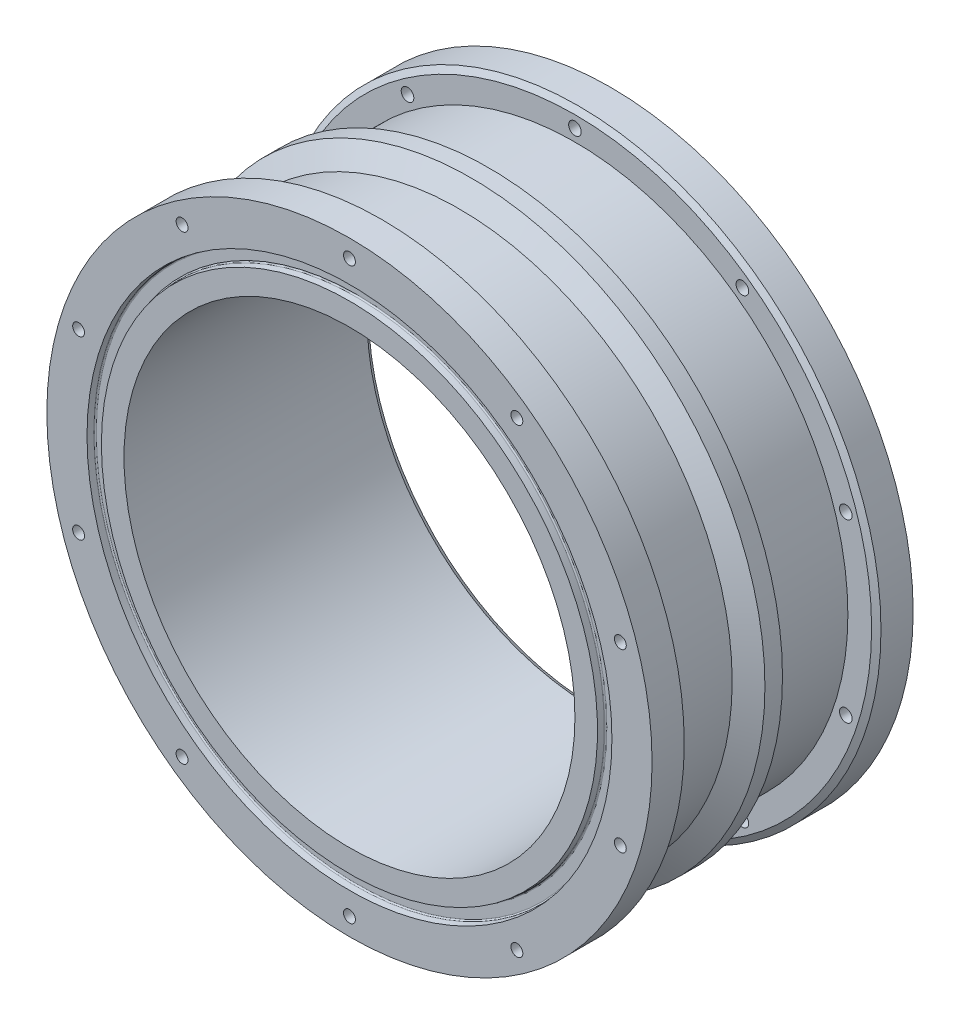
ISO-10303-21;
HEADER;
FILE_DESCRIPTION(('STEP AP214'),'2;1');
FILE_NAME('part.step','',(''),(''),'','','');
FILE_SCHEMA(('AUTOMOTIVE_DESIGN { 1 0 10303 214 1 1 1 1 }'));
ENDSEC;
DATA;
#1=APPLICATION_CONTEXT('core data for automotive mechanical design processes');
#2=APPLICATION_PROTOCOL_DEFINITION('international standard','automotive_design',2000,#1);
#3=PRODUCT_CONTEXT('',#1,'mechanical');
#4=PRODUCT('Part','Part','',(#3));
#5=PRODUCT_RELATED_PRODUCT_CATEGORY('part','',(#4));
#6=PRODUCT_DEFINITION_FORMATION('','',#4);
#7=PRODUCT_DEFINITION_CONTEXT('part definition',#1,'design');
#8=PRODUCT_DEFINITION('design','',#6,#7);
#9=PRODUCT_DEFINITION_SHAPE('','',#8);
#10=(LENGTH_UNIT() NAMED_UNIT(*) SI_UNIT(.MILLI.,.METRE.));
#11=(NAMED_UNIT(*) PLANE_ANGLE_UNIT() SI_UNIT($,.RADIAN.));
#12=(NAMED_UNIT(*) SI_UNIT($,.STERADIAN.) SOLID_ANGLE_UNIT());
#13=UNCERTAINTY_MEASURE_WITH_UNIT(LENGTH_MEASURE(1.E-05),#10,'distance_accuracy_value','');
#14=(GEOMETRIC_REPRESENTATION_CONTEXT(3) GLOBAL_UNCERTAINTY_ASSIGNED_CONTEXT((#13)) GLOBAL_UNIT_ASSIGNED_CONTEXT((#10,
#11,#12)) REPRESENTATION_CONTEXT('',''));
#15=CARTESIAN_POINT('',(0.,0.,0.));
#16=DIRECTION('',(0.,0.,1.));
#17=DIRECTION('',(1.,0.,0.));
#18=AXIS2_PLACEMENT_3D('',#15,#16,#17);
#19=CARTESIAN_POINT('',(0.,0.,139.7));
#20=DIRECTION('',(0.,0.,1.));
#21=DIRECTION('',(1.,0.,0.));
#22=AXIS2_PLACEMENT_3D('',#19,#20,#21);
#23=PLANE('',#22);
#24=CARTESIAN_POINT('',(0.,0.,139.7));
#25=DIRECTION('',(0.,0.,-1.));
#26=DIRECTION('',(-1.,0.,0.));
#27=AXIS2_PLACEMENT_3D('',#24,#25,#26);
#28=CIRCLE('',#27,132.739282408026);
#29=CARTESIAN_POINT('',(-132.739282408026,0.,139.7));
#30=VERTEX_POINT('',#29);
#31=EDGE_CURVE('E296',#30,#30,#28,.T.);
#32=ORIENTED_EDGE('',*,*,#31,.F.);
#33=EDGE_LOOP('',(#32));
#34=FACE_BOUND('',#33,.T.);
#35=CARTESIAN_POINT('',(0.,0.,139.7));
#36=DIRECTION('',(0.,0.,1.));
#37=DIRECTION('',(1.,0.,0.));
#38=AXIS2_PLACEMENT_3D('',#35,#36,#37);
#39=CIRCLE('',#38,120.65);
#40=CARTESIAN_POINT('',(120.65,0.,139.7));
#41=VERTEX_POINT('',#40);
#42=EDGE_CURVE('E182',#41,#41,#39,.T.);
#43=ORIENTED_EDGE('',*,*,#42,.F.);
#44=EDGE_LOOP('',(#43));
#45=FACE_BOUND('',#44,.T.);
#46=ADVANCED_FACE('F30',(#34,#45),#23,.T.);
#47=CARTESIAN_POINT('',(0.,0.,7.62));
#48=DIRECTION('',(0.,0.,1.));
#49=DIRECTION('',(1.,0.,0.));
#50=AXIS2_PLACEMENT_3D('',#47,#48,#49);
#51=PLANE('',#50);
#52=CARTESIAN_POINT('',(0.,0.,7.62));
#53=DIRECTION('',(0.,0.,1.));
#54=DIRECTION('',(1.,0.,0.));
#55=AXIS2_PLACEMENT_3D('',#52,#53,#54);
#56=CIRCLE('',#55,126.601079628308);
#57=CARTESIAN_POINT('',(126.601079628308,0.,7.62));
#58=VERTEX_POINT('',#57);
#59=EDGE_CURVE('E278',#58,#58,#56,.T.);
#60=ORIENTED_EDGE('',*,*,#59,.F.);
#61=EDGE_LOOP('',(#60));
#62=FACE_BOUND('',#61,.T.);
#63=CARTESIAN_POINT('',(0.,0.,7.62));
#64=DIRECTION('',(0.,0.,1.));
#65=DIRECTION('',(1.,0.,0.));
#66=AXIS2_PLACEMENT_3D('',#63,#64,#65);
#67=CIRCLE('',#66,121.823175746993);
#68=CARTESIAN_POINT('',(121.823175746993,0.,7.62));
#69=VERTEX_POINT('',#68);
#70=EDGE_CURVE('E37',#69,#69,#67,.T.);
#71=ORIENTED_EDGE('',*,*,#70,.T.);
#72=EDGE_LOOP('',(#71));
#73=FACE_BOUND('',#72,.T.);
#74=ADVANCED_FACE('F330',(#62,#73),#51,.F.);
#75=CARTESIAN_POINT('',(0.,0.,120.65));
#76=DIRECTION('',(0.,0.,-1.));
#77=DIRECTION('',(-1.,0.,0.));
#78=AXIS2_PLACEMENT_3D('',#75,#76,#77);
#79=CYLINDRICAL_SURFACE('',#78,146.05);
#80=CARTESIAN_POINT('',(0.,0.,19.05));
#81=DIRECTION('',(0.,0.,1.));
#82=DIRECTION('',(1.,0.,0.));
#83=AXIS2_PLACEMENT_3D('',#80,#81,#82);
#84=CIRCLE('',#83,146.05);
#85=CARTESIAN_POINT('',(146.05,0.,19.05));
#86=VERTEX_POINT('',#85);
#87=EDGE_CURVE('E110',#86,#86,#84,.T.);
#88=ORIENTED_EDGE('',*,*,#87,.T.);
#89=EDGE_LOOP('',(#88));
#90=FACE_BOUND('',#89,.T.);
#91=CARTESIAN_POINT('',(0.,0.,58.7375));
#92=DIRECTION('',(0.,0.,1.));
#93=DIRECTION('',(1.,0.,0.));
#94=AXIS2_PLACEMENT_3D('',#91,#92,#93);
#95=CIRCLE('',#94,146.05);
#96=CARTESIAN_POINT('',(146.05,0.,58.7375));
#97=VERTEX_POINT('',#96);
#98=EDGE_CURVE('E122',#97,#97,#95,.T.);
#99=ORIENTED_EDGE('',*,*,#98,.F.);
#100=EDGE_LOOP('',(#99));
#101=FACE_BOUND('',#100,.T.);
#102=ADVANCED_FACE('F347',(#90,#101),#79,.T.);
#103=CARTESIAN_POINT('',(0.,0.,19.05));
#104=DIRECTION('',(0.,0.,1.));
#105=DIRECTION('',(1.,0.,0.));
#106=AXIS2_PLACEMENT_3D('',#103,#104,#105);
#107=PLANE('',#106);
#108=CARTESIAN_POINT('',(89.5784724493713,123.294189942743,19.05));
#109=DIRECTION('',(0.,0.,1.));
#110=DIRECTION('',(1.,0.,0.));
#111=AXIS2_PLACEMENT_3D('',#108,#109,#110);
#112=CIRCLE('',#111,3.37819999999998);
#113=CARTESIAN_POINT('',(92.9566724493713,123.294189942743,19.05));
#114=VERTEX_POINT('',#113);
#115=EDGE_CURVE('E173',#114,#114,#112,.T.);
#116=ORIENTED_EDGE('',*,*,#115,.F.);
#117=EDGE_LOOP('',(#116));
#118=FACE_BOUND('',#117,.T.);
#119=CARTESIAN_POINT('',(144.941013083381,47.0941899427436,19.05));
#120=DIRECTION('',(0.,0.,1.));
#121=DIRECTION('',(1.,0.,0.));
#122=AXIS2_PLACEMENT_3D('',#119,#120,#121);
#123=CIRCLE('',#122,3.3782);
#124=CARTESIAN_POINT('',(148.319213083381,47.0941899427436,19.05));
#125=VERTEX_POINT('',#124);
#126=EDGE_CURVE('E167',#125,#125,#123,.T.);
#127=ORIENTED_EDGE('',*,*,#126,.F.);
#128=EDGE_LOOP('',(#127));
#129=FACE_BOUND('',#128,.T.);
#130=CARTESIAN_POINT('',(144.941013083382,-47.0941899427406,19.05));
#131=DIRECTION('',(0.,0.,1.));
#132=DIRECTION('',(1.,0.,0.));
#133=AXIS2_PLACEMENT_3D('',#130,#131,#132);
#134=CIRCLE('',#133,3.3782);
#135=CARTESIAN_POINT('',(148.319213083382,-47.0941899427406,19.05));
#136=VERTEX_POINT('',#135);
#137=EDGE_CURVE('E161',#136,#136,#134,.T.);
#138=ORIENTED_EDGE('',*,*,#137,.F.);
#139=EDGE_LOOP('',(#138));
#140=FACE_BOUND('',#139,.T.);
#141=CARTESIAN_POINT('',(89.578472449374,-123.294189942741,19.05));
#142=DIRECTION('',(0.,0.,1.));
#143=DIRECTION('',(1.,0.,0.));
#144=AXIS2_PLACEMENT_3D('',#141,#142,#143);
#145=CIRCLE('',#144,3.37819999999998);
#146=CARTESIAN_POINT('',(92.956672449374,-123.294189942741,19.05));
#147=VERTEX_POINT('',#146);
#148=EDGE_CURVE('E155',#147,#147,#145,.T.);
#149=ORIENTED_EDGE('',*,*,#148,.F.);
#150=EDGE_LOOP('',(#149));
#151=FACE_BOUND('',#150,.T.);
#152=CARTESIAN_POINT('',(1.06420412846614E-12,-152.4,19.05));
#153=DIRECTION('',(0.,0.,1.));
#154=DIRECTION('',(1.,0.,0.));
#155=AXIS2_PLACEMENT_3D('',#152,#153,#154);
#156=CIRCLE('',#155,3.37819999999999);
#157=CARTESIAN_POINT('',(3.37820000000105,-152.4,19.05));
#158=VERTEX_POINT('',#157);
#159=EDGE_CURVE('E149',#158,#158,#156,.T.);
#160=ORIENTED_EDGE('',*,*,#159,.F.);
#161=EDGE_LOOP('',(#160));
#162=FACE_BOUND('',#161,.T.);
#163=CARTESIAN_POINT('',(-89.5784724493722,-123.294189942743,19.05));
#164=DIRECTION('',(0.,0.,1.));
#165=DIRECTION('',(1.,0.,0.));
#166=AXIS2_PLACEMENT_3D('',#163,#164,#165);
#167=CIRCLE('',#166,3.37819999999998);
#168=CARTESIAN_POINT('',(-86.2002724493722,-123.294189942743,19.05));
#169=VERTEX_POINT('',#168);
#170=EDGE_CURVE('E143',#169,#169,#167,.T.);
#171=ORIENTED_EDGE('',*,*,#170,.F.);
#172=EDGE_LOOP('',(#171));
#173=FACE_BOUND('',#172,.T.);
#174=CARTESIAN_POINT('',(-144.941013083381,-47.0941899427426,19.05));
#175=DIRECTION('',(0.,0.,1.));
#176=DIRECTION('',(1.,0.,0.));
#177=AXIS2_PLACEMENT_3D('',#174,#175,#176);
#178=CIRCLE('',#177,3.3782);
#179=CARTESIAN_POINT('',(-141.562813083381,-47.0941899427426,19.05));
#180=VERTEX_POINT('',#179);
#181=EDGE_CURVE('E137',#180,#180,#178,.T.);
#182=ORIENTED_EDGE('',*,*,#181,.F.);
#183=EDGE_LOOP('',(#182));
#184=FACE_BOUND('',#183,.T.);
#185=CARTESIAN_POINT('',(-144.941013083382,47.0941899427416,19.05));
#186=DIRECTION('',(0.,0.,1.));
#187=DIRECTION('',(1.,0.,0.));
#188=AXIS2_PLACEMENT_3D('',#185,#186,#187);
#189=CIRCLE('',#188,3.3782);
#190=CARTESIAN_POINT('',(-141.562813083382,47.0941899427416,19.05));
#191=VERTEX_POINT('',#190);
#192=EDGE_CURVE('E131',#191,#191,#189,.T.);
#193=ORIENTED_EDGE('',*,*,#192,.F.);
#194=EDGE_LOOP('',(#193));
#195=FACE_BOUND('',#194,.T.);
#196=CARTESIAN_POINT('',(-89.5784724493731,123.294189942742,19.05));
#197=DIRECTION('',(0.,0.,1.));
#198=DIRECTION('',(1.,0.,0.));
#199=AXIS2_PLACEMENT_3D('',#196,#197,#198);
#200=CIRCLE('',#199,3.37819999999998);
#201=CARTESIAN_POINT('',(-86.2002724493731,123.294189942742,19.05));
#202=VERTEX_POINT('',#201);
#203=EDGE_CURVE('E125',#202,#202,#200,.T.);
#204=ORIENTED_EDGE('',*,*,#203,.F.);
#205=EDGE_LOOP('',(#204));
#206=FACE_BOUND('',#205,.T.);
#207=CARTESIAN_POINT('',(0.,0.,19.05));
#208=DIRECTION('',(0.,0.,1.));
#209=DIRECTION('',(1.,0.,0.));
#210=AXIS2_PLACEMENT_3D('',#207,#208,#209);
#211=CIRCLE('',#210,158.75);
#212=CARTESIAN_POINT('',(158.75,0.,19.05));
#213=VERTEX_POINT('',#212);
#214=EDGE_CURVE('E95',#213,#213,#211,.T.);
#215=ORIENTED_EDGE('',*,*,#214,.T.);
#216=EDGE_LOOP('',(#215));
#217=FACE_BOUND('',#216,.T.);
#218=CARTESIAN_POINT('',(0.,152.4,19.05));
#219=DIRECTION('',(0.,0.,1.));
#220=DIRECTION('',(1.,0.,0.));
#221=AXIS2_PLACEMENT_3D('',#218,#219,#220);
#222=CIRCLE('',#221,3.37819999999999);
#223=CARTESIAN_POINT('',(3.37819999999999,152.4,19.05));
#224=VERTEX_POINT('',#223);
#225=EDGE_CURVE('E113',#224,#224,#222,.T.);
#226=ORIENTED_EDGE('',*,*,#225,.F.);
#227=EDGE_LOOP('',(#226));
#228=FACE_BOUND('',#227,.T.);
#229=ORIENTED_EDGE('',*,*,#87,.F.);
#230=EDGE_LOOP('',(#229));
#231=FACE_BOUND('',#230,.T.);
#232=ADVANCED_FACE('F353',(#118,#129,#140,#151,#162,#173,#184,#195,#206,#217,#228,#231),#107,.T.);
#233=CARTESIAN_POINT('',(0.,0.,0.));
#234=DIRECTION('',(0.,0.,1.));
#235=DIRECTION('',(1.,0.,0.));
#236=AXIS2_PLACEMENT_3D('',#233,#234,#235);
#237=PLANE('',#236);
#238=CARTESIAN_POINT('',(0.,0.,0.));
#239=DIRECTION('',(0.,0.,1.));
#240=DIRECTION('',(1.,0.,0.));
#241=AXIS2_PLACEMENT_3D('',#238,#239,#240);
#242=CIRCLE('',#241,139.578969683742);
#243=CARTESIAN_POINT('',(139.578969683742,0.,0.));
#244=VERTEX_POINT('',#243);
#245=EDGE_CURVE('E45',#244,#244,#242,.T.);
#246=ORIENTED_EDGE('',*,*,#245,.T.);
#247=EDGE_LOOP('',(#246));
#248=FACE_BOUND('',#247,.T.);
#249=CARTESIAN_POINT('',(89.5784724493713,123.294189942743,0.));
#250=DIRECTION('',(0.,0.,1.));
#251=DIRECTION('',(1.,0.,0.));
#252=AXIS2_PLACEMENT_3D('',#249,#250,#251);
#253=CIRCLE('',#252,3.3782);
#254=CARTESIAN_POINT('',(92.9566724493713,123.294189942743,0.));
#255=VERTEX_POINT('',#254);
#256=EDGE_CURVE('E176',#255,#255,#253,.T.);
#257=ORIENTED_EDGE('',*,*,#256,.T.);
#258=EDGE_LOOP('',(#257));
#259=FACE_BOUND('',#258,.T.);
#260=CARTESIAN_POINT('',(144.941013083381,47.0941899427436,0.));
#261=DIRECTION('',(0.,0.,1.));
#262=DIRECTION('',(1.,0.,0.));
#263=AXIS2_PLACEMENT_3D('',#260,#261,#262);
#264=CIRCLE('',#263,3.3782);
#265=CARTESIAN_POINT('',(148.319213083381,47.0941899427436,0.));
#266=VERTEX_POINT('',#265);
#267=EDGE_CURVE('E170',#266,#266,#264,.T.);
#268=ORIENTED_EDGE('',*,*,#267,.T.);
#269=EDGE_LOOP('',(#268));
#270=FACE_BOUND('',#269,.T.);
#271=CARTESIAN_POINT('',(144.941013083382,-47.0941899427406,0.));
#272=DIRECTION('',(0.,0.,1.));
#273=DIRECTION('',(1.,0.,0.));
#274=AXIS2_PLACEMENT_3D('',#271,#272,#273);
#275=CIRCLE('',#274,3.3782);
#276=CARTESIAN_POINT('',(148.319213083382,-47.0941899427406,0.));
#277=VERTEX_POINT('',#276);
#278=EDGE_CURVE('E164',#277,#277,#275,.T.);
#279=ORIENTED_EDGE('',*,*,#278,.T.);
#280=EDGE_LOOP('',(#279));
#281=FACE_BOUND('',#280,.T.);
#282=CARTESIAN_POINT('',(89.578472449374,-123.294189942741,0.));
#283=DIRECTION('',(0.,0.,1.));
#284=DIRECTION('',(1.,0.,0.));
#285=AXIS2_PLACEMENT_3D('',#282,#283,#284);
#286=CIRCLE('',#285,3.3782);
#287=CARTESIAN_POINT('',(92.956672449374,-123.294189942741,0.));
#288=VERTEX_POINT('',#287);
#289=EDGE_CURVE('E158',#288,#288,#286,.T.);
#290=ORIENTED_EDGE('',*,*,#289,.T.);
#291=EDGE_LOOP('',(#290));
#292=FACE_BOUND('',#291,.T.);
#293=CARTESIAN_POINT('',(1.06420412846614E-12,-152.4,0.));
#294=DIRECTION('',(0.,0.,1.));
#295=DIRECTION('',(1.,0.,0.));
#296=AXIS2_PLACEMENT_3D('',#293,#294,#295);
#297=CIRCLE('',#296,3.3782);
#298=CARTESIAN_POINT('',(3.37820000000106,-152.4,0.));
#299=VERTEX_POINT('',#298);
#300=EDGE_CURVE('E152',#299,#299,#297,.T.);
#301=ORIENTED_EDGE('',*,*,#300,.T.);
#302=EDGE_LOOP('',(#301));
#303=FACE_BOUND('',#302,.T.);
#304=CARTESIAN_POINT('',(-89.5784724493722,-123.294189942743,0.));
#305=DIRECTION('',(0.,0.,1.));
#306=DIRECTION('',(1.,0.,0.));
#307=AXIS2_PLACEMENT_3D('',#304,#305,#306);
#308=CIRCLE('',#307,3.3782);
#309=CARTESIAN_POINT('',(-86.2002724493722,-123.294189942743,0.));
#310=VERTEX_POINT('',#309);
#311=EDGE_CURVE('E146',#310,#310,#308,.T.);
#312=ORIENTED_EDGE('',*,*,#311,.T.);
#313=EDGE_LOOP('',(#312));
#314=FACE_BOUND('',#313,.T.);
#315=CARTESIAN_POINT('',(-144.941013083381,-47.0941899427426,0.));
#316=DIRECTION('',(0.,0.,1.));
#317=DIRECTION('',(1.,0.,0.));
#318=AXIS2_PLACEMENT_3D('',#315,#316,#317);
#319=CIRCLE('',#318,3.3782);
#320=CARTESIAN_POINT('',(-141.562813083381,-47.0941899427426,0.));
#321=VERTEX_POINT('',#320);
#322=EDGE_CURVE('E140',#321,#321,#319,.T.);
#323=ORIENTED_EDGE('',*,*,#322,.T.);
#324=EDGE_LOOP('',(#323));
#325=FACE_BOUND('',#324,.T.);
#326=CARTESIAN_POINT('',(-144.941013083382,47.0941899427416,0.));
#327=DIRECTION('',(0.,0.,1.));
#328=DIRECTION('',(1.,0.,0.));
#329=AXIS2_PLACEMENT_3D('',#326,#327,#328);
#330=CIRCLE('',#329,3.3782);
#331=CARTESIAN_POINT('',(-141.562813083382,47.0941899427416,0.));
#332=VERTEX_POINT('',#331);
#333=EDGE_CURVE('E134',#332,#332,#330,.T.);
#334=ORIENTED_EDGE('',*,*,#333,.T.);
#335=EDGE_LOOP('',(#334));
#336=FACE_BOUND('',#335,.T.);
#337=CARTESIAN_POINT('',(-89.5784724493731,123.294189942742,0.));
#338=DIRECTION('',(0.,0.,1.));
#339=DIRECTION('',(1.,0.,0.));
#340=AXIS2_PLACEMENT_3D('',#337,#338,#339);
#341=CIRCLE('',#340,3.3782);
#342=CARTESIAN_POINT('',(-86.2002724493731,123.294189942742,0.));
#343=VERTEX_POINT('',#342);
#344=EDGE_CURVE('E128',#343,#343,#341,.T.);
#345=ORIENTED_EDGE('',*,*,#344,.T.);
#346=EDGE_LOOP('',(#345));
#347=FACE_BOUND('',#346,.T.);
#348=CARTESIAN_POINT('',(0.,152.4,0.));
#349=DIRECTION('',(0.,0.,1.));
#350=DIRECTION('',(1.,0.,0.));
#351=AXIS2_PLACEMENT_3D('',#348,#349,#350);
#352=CIRCLE('',#351,3.3782);
#353=CARTESIAN_POINT('',(3.3782,152.4,0.));
#354=VERTEX_POINT('',#353);
#355=EDGE_CURVE('E116',#354,#354,#352,.T.);
#356=ORIENTED_EDGE('',*,*,#355,.T.);
#357=EDGE_LOOP('',(#356));
#358=FACE_BOUND('',#357,.T.);
#359=CARTESIAN_POINT('',(0.,0.,0.));
#360=DIRECTION('',(0.,0.,1.));
#361=DIRECTION('',(1.,0.,0.));
#362=AXIS2_PLACEMENT_3D('',#359,#360,#361);
#363=CIRCLE('',#362,161.925);
#364=CARTESIAN_POINT('',(-161.925,0.,0.));
#365=VERTEX_POINT('',#364);
#366=EDGE_CURVE('E104',#365,#365,#363,.T.);
#367=ORIENTED_EDGE('',*,*,#366,.F.);
#368=EDGE_LOOP('',(#367));
#369=FACE_BOUND('',#368,.T.);
#370=ADVANCED_FACE('F356',(#248,#259,#270,#281,#292,#303,#314,#325,#336,#347,#358,#369),#237,.F.);
#371=CARTESIAN_POINT('',(0.,0.,7.62));
#372=DIRECTION('',(0.,0.,-1.));
#373=DIRECTION('',(-1.,0.,0.));
#374=AXIS2_PLACEMENT_3D('',#371,#372,#373);
#375=CYLINDRICAL_SURFACE('',#374,161.925);
#376=CARTESIAN_POINT('',(0.,0.,17.2169128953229));
#377=DIRECTION('',(0.,0.,1.));
#378=DIRECTION('',(1.,0.,0.));
#379=AXIS2_PLACEMENT_3D('',#376,#377,#378);
#380=CIRCLE('',#379,161.925);
#381=CARTESIAN_POINT('',(-161.925,0.,17.2169128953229));
#382=VERTEX_POINT('',#381);
#383=EDGE_CURVE('E92',#382,#382,#380,.F.);
#384=CARTESIAN_POINT('',(-161.925,0.,17.2169128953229));
#385=CARTESIAN_POINT('',(-161.925,0.,17.0375700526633));
#386=CARTESIAN_POINT('',(-161.925,0.,16.8582272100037));
#387=CARTESIAN_POINT('',(-161.925,0.,16.4995415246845));
#388=CARTESIAN_POINT('',(-161.925,0.,16.3201986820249));
#389=CARTESIAN_POINT('',(-161.925,0.,15.9615129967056));
#390=CARTESIAN_POINT('',(-161.925,0.,15.782170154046));
#391=CARTESIAN_POINT('',(-161.925,0.,15.4234844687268));
#392=CARTESIAN_POINT('',(-161.925,0.,15.2441416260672));
#393=CARTESIAN_POINT('',(-161.925,0.,14.885455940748));
#394=CARTESIAN_POINT('',(-161.925,0.,14.7061130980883));
#395=CARTESIAN_POINT('',(-161.925,0.,14.3474274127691));
#396=CARTESIAN_POINT('',(-161.925,0.,14.1680845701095));
#397=CARTESIAN_POINT('',(-161.925,0.,13.8093988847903));
#398=CARTESIAN_POINT('',(-161.925,0.,13.6300560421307));
#399=CARTESIAN_POINT('',(-161.925,0.,13.2713703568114));
#400=CARTESIAN_POINT('',(-161.925,0.,13.0920275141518));
#401=CARTESIAN_POINT('',(-161.925,0.,12.7333418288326));
#402=CARTESIAN_POINT('',(-161.925,0.,12.553998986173));
#403=CARTESIAN_POINT('',(-161.925,0.,12.1953133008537));
#404=CARTESIAN_POINT('',(-161.925,0.,12.0159704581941));
#405=CARTESIAN_POINT('',(-161.925,0.,11.6572847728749));
#406=CARTESIAN_POINT('',(-161.925,0.,11.4779419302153));
#407=CARTESIAN_POINT('',(-161.925,0.,11.1192562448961));
#408=CARTESIAN_POINT('',(-161.925,0.,10.9399134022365));
#409=CARTESIAN_POINT('',(-161.925,0.,10.5812277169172));
#410=CARTESIAN_POINT('',(-161.925,0.,10.4018848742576));
#411=CARTESIAN_POINT('',(-161.925,0.,10.0431991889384));
#412=CARTESIAN_POINT('',(-161.925,0.,9.86385634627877));
#413=CARTESIAN_POINT('',(-161.925,0.,9.50517066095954));
#414=CARTESIAN_POINT('',(-161.925,0.,9.32582781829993));
#415=CARTESIAN_POINT('',(-161.925,0.,8.9671421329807));
#416=CARTESIAN_POINT('',(-161.925,0.,8.78779929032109));
#417=CARTESIAN_POINT('',(-161.925,0.,8.42911360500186));
#418=CARTESIAN_POINT('',(-161.925,0.,8.24977076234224));
#419=CARTESIAN_POINT('',(-161.925,0.,7.89108507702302));
#420=CARTESIAN_POINT('',(-161.925,0.,7.7117422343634));
#421=CARTESIAN_POINT('',(-161.925,0.,7.35305654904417));
#422=CARTESIAN_POINT('',(-161.925,0.,7.17371370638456));
#423=CARTESIAN_POINT('',(-161.925,0.,6.81502802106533));
#424=CARTESIAN_POINT('',(-161.925,0.,6.63568517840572));
#425=CARTESIAN_POINT('',(-161.925,0.,6.27699949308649));
#426=CARTESIAN_POINT('',(-161.925,0.,6.09765665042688));
#427=CARTESIAN_POINT('',(-161.925,0.,5.73897096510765));
#428=CARTESIAN_POINT('',(-161.925,0.,5.55962812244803));
#429=CARTESIAN_POINT('',(-161.925,0.,5.20094243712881));
#430=CARTESIAN_POINT('',(-161.925,0.,5.02159959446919));
#431=CARTESIAN_POINT('',(-161.925,0.,4.66291390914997));
#432=CARTESIAN_POINT('',(-161.925,0.,4.48357106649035));
#433=CARTESIAN_POINT('',(-161.925,0.,4.12488538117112));
#434=CARTESIAN_POINT('',(-161.925,0.,3.94554253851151));
#435=CARTESIAN_POINT('',(-161.925,0.,3.58685685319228));
#436=CARTESIAN_POINT('',(-161.925,0.,3.40751401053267));
#437=CARTESIAN_POINT('',(-161.925,0.,3.04882832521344));
#438=CARTESIAN_POINT('',(-161.925,0.,2.86948548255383));
#439=CARTESIAN_POINT('',(-161.925,0.,2.5107997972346));
#440=CARTESIAN_POINT('',(-161.925,0.,2.33145695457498));
#441=CARTESIAN_POINT('',(-161.925,0.,1.97277126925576));
#442=CARTESIAN_POINT('',(-161.925,0.,1.79342842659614));
#443=CARTESIAN_POINT('',(-161.925,0.,1.43474274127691));
#444=CARTESIAN_POINT('',(-161.925,0.,1.2553998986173));
#445=CARTESIAN_POINT('',(-161.925,0.,0.896714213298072));
#446=CARTESIAN_POINT('',(-161.925,0.,0.717371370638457));
#447=CARTESIAN_POINT('',(-161.925,0.,0.358685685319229));
#448=CARTESIAN_POINT('',(-161.925,0.,0.179342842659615));
#449=CARTESIAN_POINT('',(-161.925,0.,0.));
#450=B_SPLINE_CURVE_WITH_KNOTS('',3,(#384,#385,#386,#387,#388,#389,#390,#391,#392,#393,#394,
#395,#396,#397,#398,#399,#400,#401,#402,#403,#404,#405,#406,#407,#408,#409,#410,#411,#412,#413,
#414,#415,#416,#417,#418,#419,#420,#421,#422,#423,#424,#425,#426,#427,#428,#429,#430,#431,#432,
#433,#434,#435,#436,#437,#438,#439,#440,#441,#442,#443,#444,#445,#446,#447,#448,#449),
.UNSPECIFIED.,.F.,.F.,(4,2,2,2,2,2,2,2,2,2,2,2,2,2,2,2,2,2,2,2,2,2,2,2,2,2,2,2,2,2,2,2,4),(0.,
0.538028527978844,1.07605705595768,1.61408558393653,2.15211411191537,2.69014263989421,
3.22817116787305,3.76619969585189,4.30422822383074,4.84225675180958,5.38028527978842,
5.91831380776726,6.4563423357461,6.99437086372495,7.53239939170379,8.07042791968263,
8.60845644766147,9.14648497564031,9.68451350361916,10.222542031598,10.7605705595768,
11.2985990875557,11.8366276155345,12.3746561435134,12.9126846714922,13.450713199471,
13.9887417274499,14.5267702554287,15.0647987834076,15.6028273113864,16.1408558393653,
16.6788843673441,17.2169128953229),.UNSPECIFIED.);
#451=EDGE_CURVE('BSEAM32',#382,#365,#450,.T.);
#452=ORIENTED_EDGE('',*,*,#383,.T.);
#453=ORIENTED_EDGE('',*,*,#366,.T.);
#454=ORIENTED_EDGE('',*,*,#451,.T.);
#455=ORIENTED_EDGE('',*,*,#451,.F.);
#456=EDGE_LOOP('',(#452,#454,#453,#455));
#457=FACE_BOUND('',#456,.T.);
#458=ADVANCED_FACE('F32',(#457),#375,.T.);
#459=CARTESIAN_POINT('',(0.,0.,7.62));
#460=DIRECTION('',(0.,0.,-1.));
#461=DIRECTION('',(-1.,0.,0.));
#462=AXIS2_PLACEMENT_3D('',#459,#460,#461);
#463=CYLINDRICAL_SURFACE('',#462,138.1125);
#464=CARTESIAN_POINT('',(0.,0.,2.54000000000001));
#465=DIRECTION('',(0.,0.,1.));
#466=DIRECTION('',(1.,0.,0.));
#467=AXIS2_PLACEMENT_3D('',#464,#465,#466);
#468=CIRCLE('',#467,138.1125);
#469=CARTESIAN_POINT('',(-138.1125,0.,2.54000000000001));
#470=VERTEX_POINT('',#469);
#471=EDGE_CURVE('E41',#470,#470,#468,.F.);
#472=CARTESIAN_POINT('',(0.,0.,5.64026592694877));
#473=DIRECTION('',(0.,0.,1.));
#474=DIRECTION('',(1.,0.,0.));
#475=AXIS2_PLACEMENT_3D('',#472,#473,#474);
#476=CIRCLE('',#475,138.1125);
#477=CARTESIAN_POINT('',(-138.1125,0.,5.64026592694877));
#478=VERTEX_POINT('',#477);
#479=EDGE_CURVE('E53',#478,#478,#476,.T.);
#480=CARTESIAN_POINT('',(-138.1125,0.,2.54000000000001));
#481=CARTESIAN_POINT('',(-138.1125,0.,2.57229443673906));
#482=CARTESIAN_POINT('',(-138.1125,0.,2.60458887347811));
#483=CARTESIAN_POINT('',(-138.1125,0.,2.66917774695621));
#484=CARTESIAN_POINT('',(-138.1125,0.,2.70147218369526));
#485=CARTESIAN_POINT('',(-138.1125,0.,2.76606105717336));
#486=CARTESIAN_POINT('',(-138.1125,0.,2.79835549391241));
#487=CARTESIAN_POINT('',(-138.1125,0.,2.86294436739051));
#488=CARTESIAN_POINT('',(-138.1125,0.,2.89523880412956));
#489=CARTESIAN_POINT('',(-138.1125,0.,2.95982767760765));
#490=CARTESIAN_POINT('',(-138.1125,0.,2.9921221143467));
#491=CARTESIAN_POINT('',(-138.1125,0.,3.0567109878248));
#492=CARTESIAN_POINT('',(-138.1125,0.,3.08900542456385));
#493=CARTESIAN_POINT('',(-138.1125,0.,3.15359429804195));
#494=CARTESIAN_POINT('',(-138.1125,0.,3.185888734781));
#495=CARTESIAN_POINT('',(-138.1125,0.,3.2504776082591));
#496=CARTESIAN_POINT('',(-138.1125,0.,3.28277204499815));
#497=CARTESIAN_POINT('',(-138.1125,0.,3.34736091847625));
#498=CARTESIAN_POINT('',(-138.1125,0.,3.3796553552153));
#499=CARTESIAN_POINT('',(-138.1125,0.,3.4442442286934));
#500=CARTESIAN_POINT('',(-138.1125,0.,3.47653866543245));
#501=CARTESIAN_POINT('',(-138.1125,0.,3.54112753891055));
#502=CARTESIAN_POINT('',(-138.1125,0.,3.5734219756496));
#503=CARTESIAN_POINT('',(-138.1125,0.,3.6380108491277));
#504=CARTESIAN_POINT('',(-138.1125,0.,3.67030528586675));
#505=CARTESIAN_POINT('',(-138.1125,0.,3.73489415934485));
#506=CARTESIAN_POINT('',(-138.1125,0.,3.76718859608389));
#507=CARTESIAN_POINT('',(-138.1125,0.,3.83177746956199));
#508=CARTESIAN_POINT('',(-138.1125,0.,3.86407190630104));
#509=CARTESIAN_POINT('',(-138.1125,0.,3.92866077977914));
#510=CARTESIAN_POINT('',(-138.1125,0.,3.96095521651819));
#511=CARTESIAN_POINT('',(-138.1125,0.,4.02554408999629));
#512=CARTESIAN_POINT('',(-138.1125,0.,4.05783852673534));
#513=CARTESIAN_POINT('',(-138.1125,0.,4.12242740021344));
#514=CARTESIAN_POINT('',(-138.1125,0.,4.15472183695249));
#515=CARTESIAN_POINT('',(-138.1125,0.,4.21931071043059));
#516=CARTESIAN_POINT('',(-138.1125,0.,4.25160514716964));
#517=CARTESIAN_POINT('',(-138.1125,0.,4.31619402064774));
#518=CARTESIAN_POINT('',(-138.1125,0.,4.34848845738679));
#519=CARTESIAN_POINT('',(-138.1125,0.,4.41307733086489));
#520=CARTESIAN_POINT('',(-138.1125,0.,4.44537176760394));
#521=CARTESIAN_POINT('',(-138.1125,0.,4.50996064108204));
#522=CARTESIAN_POINT('',(-138.1125,0.,4.54225507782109));
#523=CARTESIAN_POINT('',(-138.1125,0.,4.60684395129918));
#524=CARTESIAN_POINT('',(-138.1125,0.,4.63913838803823));
#525=CARTESIAN_POINT('',(-138.1125,0.,4.70372726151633));
#526=CARTESIAN_POINT('',(-138.1125,0.,4.73602169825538));
#527=CARTESIAN_POINT('',(-138.1125,0.,4.80061057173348));
#528=CARTESIAN_POINT('',(-138.1125,0.,4.83290500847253));
#529=CARTESIAN_POINT('',(-138.1125,0.,4.89749388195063));
#530=CARTESIAN_POINT('',(-138.1125,0.,4.92978831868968));
#531=CARTESIAN_POINT('',(-138.1125,0.,4.99437719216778));
#532=CARTESIAN_POINT('',(-138.1125,0.,5.02667162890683));
#533=CARTESIAN_POINT('',(-138.1125,0.,5.09126050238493));
#534=CARTESIAN_POINT('',(-138.1125,0.,5.12355493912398));
#535=CARTESIAN_POINT('',(-138.1125,0.,5.18814381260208));
#536=CARTESIAN_POINT('',(-138.1125,0.,5.22043824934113));
#537=CARTESIAN_POINT('',(-138.1125,0.,5.28502712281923));
#538=CARTESIAN_POINT('',(-138.1125,0.,5.31732155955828));
#539=CARTESIAN_POINT('',(-138.1125,0.,5.38191043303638));
#540=CARTESIAN_POINT('',(-138.1125,0.,5.41420486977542));
#541=CARTESIAN_POINT('',(-138.1125,0.,5.47879374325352));
#542=CARTESIAN_POINT('',(-138.1125,0.,5.51108817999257));
#543=CARTESIAN_POINT('',(-138.1125,0.,5.57567705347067));
#544=CARTESIAN_POINT('',(-138.1125,0.,5.60797149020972));
#545=CARTESIAN_POINT('',(-138.1125,0.,5.64026592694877));
#546=B_SPLINE_CURVE_WITH_KNOTS('',3,(#480,#481,#482,#483,#484,#485,#486,#487,#488,#489,#490,
#491,#492,#493,#494,#495,#496,#497,#498,#499,#500,#501,#502,#503,#504,#505,#506,#507,#508,#509,
#510,#511,#512,#513,#514,#515,#516,#517,#518,#519,#520,#521,#522,#523,#524,#525,#526,#527,#528,
#529,#530,#531,#532,#533,#534,#535,#536,#537,#538,#539,#540,#541,#542,#543,#544,#545),
.UNSPECIFIED.,.F.,.F.,(4,2,2,2,2,2,2,2,2,2,2,2,2,2,2,2,2,2,2,2,2,2,2,2,2,2,2,2,2,2,2,2,4),(0.,
0.0968833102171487,0.193766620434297,0.290649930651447,0.387533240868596,0.484416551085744,
0.581299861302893,0.678183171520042,0.775066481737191,0.87194979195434,0.968833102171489,
1.06571641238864,1.16259972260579,1.25948303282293,1.35636634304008,1.45324965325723,
1.55013296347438,1.64701627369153,1.74389958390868,1.84078289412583,1.93766620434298,
2.03454951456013,2.13143282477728,2.22831613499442,2.32519944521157,2.42208275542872,
2.51896606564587,2.61584937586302,2.71273268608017,2.80961599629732,2.90649930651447,
3.00338261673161,3.10026592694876),.UNSPECIFIED.);
#547=EDGE_CURVE('BSEAM348',#470,#478,#546,.T.);
#548=ORIENTED_EDGE('',*,*,#471,.T.);
#549=ORIENTED_EDGE('',*,*,#479,.T.);
#550=ORIENTED_EDGE('',*,*,#547,.T.);
#551=ORIENTED_EDGE('',*,*,#547,.F.);
#552=EDGE_LOOP('',(#548,#550,#549,#551));
#553=FACE_BOUND('',#552,.T.);
#554=ADVANCED_FACE('F348',(#553),#463,.F.);
#555=CARTESIAN_POINT('',(0.,0.,7.62));
#556=DIRECTION('',(0.,0.,1.));
#557=DIRECTION('',(1.,0.,0.));
#558=AXIS2_PLACEMENT_3D('',#555,#556,#557);
#559=CIRCLE('',#558,131.615096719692);
#560=CARTESIAN_POINT('',(131.615096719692,0.,7.62));
#561=VERTEX_POINT('',#560);
#562=EDGE_CURVE('E281',#561,#561,#559,.T.);
#563=ORIENTED_EDGE('',*,*,#562,.T.);
#564=EDGE_LOOP('',(#563));
#565=FACE_BOUND('',#564,.T.);
#566=CARTESIAN_POINT('',(0.,0.,7.62));
#567=DIRECTION('',(0.,0.,1.));
#568=DIRECTION('',(1.,0.,0.));
#569=AXIS2_PLACEMENT_3D('',#566,#567,#568);
#570=CIRCLE('',#569,136.9695);
#571=CARTESIAN_POINT('',(136.9695,0.,7.62));
#572=VERTEX_POINT('',#571);
#573=EDGE_CURVE('E50',#572,#572,#570,.F.);
#574=ORIENTED_EDGE('',*,*,#573,.T.);
#575=EDGE_LOOP('',(#574));
#576=FACE_BOUND('',#575,.T.);
#577=ADVANCED_FACE('F338',(#565,#576),#51,.F.);
#578=CARTESIAN_POINT('',(0.,0.,19.05));
#579=DIRECTION('',(0.,0.,-1.));
#580=DIRECTION('',(-1.,0.,0.));
#581=AXIS2_PLACEMENT_3D('',#578,#579,#580);
#582=CYLINDRICAL_SURFACE('',#581,120.65);
#583=CARTESIAN_POINT('',(0.,0.,9.65200000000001));
#584=DIRECTION('',(0.,0.,1.));
#585=DIRECTION('',(1.,0.,0.));
#586=AXIS2_PLACEMENT_3D('',#583,#584,#585);
#587=CIRCLE('',#586,120.65);
#588=CARTESIAN_POINT('',(120.65,0.,9.65200000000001));
#589=VERTEX_POINT('',#588);
#590=EDGE_CURVE('E10',#589,#589,#587,.F.);
#591=ORIENTED_EDGE('',*,*,#590,.T.);
#592=EDGE_LOOP('',(#591));
#593=FACE_BOUND('',#592,.T.);
#594=ORIENTED_EDGE('',*,*,#42,.T.);
#595=EDGE_LOOP('',(#594));
#596=FACE_BOUND('',#595,.T.);
#597=ADVANCED_FACE('F335',(#593,#596),#582,.F.);
#598=CARTESIAN_POINT('',(0.,0.,80.9625));
#599=DIRECTION('',(0.,0.,1.));
#600=DIRECTION('',(1.,0.,0.));
#601=AXIS2_PLACEMENT_3D('',#598,#599,#600);
#602=CIRCLE('',#601,146.05);
#603=CARTESIAN_POINT('',(146.05,0.,80.9625));
#604=VERTEX_POINT('',#603);
#605=EDGE_CURVE('E119',#604,#604,#602,.T.);
#606=ORIENTED_EDGE('',*,*,#605,.T.);
#607=EDGE_LOOP('',(#606));
#608=FACE_BOUND('',#607,.T.);
#609=CARTESIAN_POINT('',(0.,0.,120.65));
#610=DIRECTION('',(0.,0.,1.));
#611=DIRECTION('',(1.,0.,0.));
#612=AXIS2_PLACEMENT_3D('',#609,#610,#611);
#613=CIRCLE('',#612,146.05);
#614=CARTESIAN_POINT('',(146.05,0.,120.65));
#615=VERTEX_POINT('',#614);
#616=EDGE_CURVE('E107',#615,#615,#613,.T.);
#617=ORIENTED_EDGE('',*,*,#616,.F.);
#618=EDGE_LOOP('',(#617));
#619=FACE_BOUND('',#618,.T.);
#620=ADVANCED_FACE('F337',(#608,#619),#79,.T.);
#621=CARTESIAN_POINT('',(0.,152.4,19.05));
#622=DIRECTION('',(0.,0.,1.));
#623=DIRECTION('',(1.,0.,0.));
#624=AXIS2_PLACEMENT_3D('',#621,#622,#623);
#625=CYLINDRICAL_SURFACE('',#624,3.37819999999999);
#626=ORIENTED_EDGE('',*,*,#355,.F.);
#627=EDGE_LOOP('',(#626));
#628=FACE_BOUND('',#627,.T.);
#629=ORIENTED_EDGE('',*,*,#225,.T.);
#630=EDGE_LOOP('',(#629));
#631=FACE_BOUND('',#630,.T.);
#632=ADVANCED_FACE('F344',(#628,#631),#625,.F.);
#633=CARTESIAN_POINT('',(0.,0.,80.9625));
#634=DIRECTION('',(0.,0.,-1.));
#635=DIRECTION('',(-1.,0.,0.));
#636=AXIS2_PLACEMENT_3D('',#633,#634,#635);
#637=CYLINDRICAL_SURFACE('',#636,157.1625);
#638=CARTESIAN_POINT('',(0.,0.,74.5466951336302));
#639=DIRECTION('',(0.,0.,1.));
#640=DIRECTION('',(1.,0.,0.));
#641=AXIS2_PLACEMENT_3D('',#638,#639,#640);
#642=CIRCLE('',#641,157.1625);
#643=CARTESIAN_POINT('',(157.1625,0.,74.5466951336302));
#644=VERTEX_POINT('',#643);
#645=EDGE_CURVE('E98',#644,#644,#642,.F.);
#646=ORIENTED_EDGE('',*,*,#645,.T.);
#647=EDGE_LOOP('',(#646));
#648=FACE_BOUND('',#647,.T.);
#649=CARTESIAN_POINT('',(0.,0.,65.1533048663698));
#650=DIRECTION('',(0.,0.,1.));
#651=DIRECTION('',(1.,0.,0.));
#652=AXIS2_PLACEMENT_3D('',#649,#650,#651);
#653=CIRCLE('',#652,157.1625);
#654=CARTESIAN_POINT('',(157.1625,0.,65.1533048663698));
#655=VERTEX_POINT('',#654);
#656=EDGE_CURVE('E101',#655,#655,#653,.T.);
#657=ORIENTED_EDGE('',*,*,#656,.T.);
#658=EDGE_LOOP('',(#657));
#659=FACE_BOUND('',#658,.T.);
#660=ADVANCED_FACE('F393',(#648,#659),#637,.T.);
#661=CARTESIAN_POINT('',(0.,0.,80.9625));
#662=DIRECTION('',(0.,0.,-1.));
#663=DIRECTION('',(-1.,0.,0.));
#664=AXIS2_PLACEMENT_3D('',#661,#662,#663);
#665=CONICAL_SURFACE('',#664,146.05,1.04719755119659);
#666=ORIENTED_EDGE('',*,*,#645,.F.);
#667=EDGE_LOOP('',(#666));
#668=FACE_BOUND('',#667,.T.);
#669=ORIENTED_EDGE('',*,*,#605,.F.);
#670=EDGE_LOOP('',(#669));
#671=FACE_BOUND('',#670,.T.);
#672=ADVANCED_FACE('F407',(#668,#671),#665,.T.);
#673=CARTESIAN_POINT('',(0.,0.,65.1533048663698));
#674=DIRECTION('',(0.,0.,1.));
#675=DIRECTION('',(1.,0.,0.));
#676=AXIS2_PLACEMENT_3D('',#673,#674,#675);
#677=CONICAL_SURFACE('',#676,157.1625,1.04719755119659);
#678=ORIENTED_EDGE('',*,*,#98,.T.);
#679=EDGE_LOOP('',(#678));
#680=FACE_BOUND('',#679,.T.);
#681=ORIENTED_EDGE('',*,*,#656,.F.);
#682=EDGE_LOOP('',(#681));
#683=FACE_BOUND('',#682,.T.);
#684=ADVANCED_FACE('F403',(#680,#683),#677,.T.);
#685=CARTESIAN_POINT('',(0.,0.,19.05));
#686=DIRECTION('',(0.,0.,-1.));
#687=DIRECTION('',(-1.,0.,0.));
#688=AXIS2_PLACEMENT_3D('',#685,#686,#687);
#689=CONICAL_SURFACE('',#688,158.75,1.0471975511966);
#690=ORIENTED_EDGE('',*,*,#383,.F.);
#691=EDGE_LOOP('',(#690));
#692=FACE_BOUND('',#691,.T.);
#693=ORIENTED_EDGE('',*,*,#214,.F.);
#694=EDGE_LOOP('',(#693));
#695=FACE_BOUND('',#694,.T.);
#696=ADVANCED_FACE('F406',(#692,#695),#689,.T.);
#697=CARTESIAN_POINT('',(-89.5784724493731,123.294189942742,19.05));
#698=DIRECTION('',(0.,0.,1.));
#699=DIRECTION('',(1.,0.,0.));
#700=AXIS2_PLACEMENT_3D('',#697,#698,#699);
#701=CYLINDRICAL_SURFACE('',#700,3.37819999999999);
#702=ORIENTED_EDGE('',*,*,#344,.F.);
#703=EDGE_LOOP('',(#702));
#704=FACE_BOUND('',#703,.T.);
#705=ORIENTED_EDGE('',*,*,#203,.T.);
#706=EDGE_LOOP('',(#705));
#707=FACE_BOUND('',#706,.T.);
#708=ADVANCED_FACE('F422',(#704,#707),#701,.F.);
#709=CARTESIAN_POINT('',(-144.941013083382,47.0941899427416,19.05));
#710=DIRECTION('',(0.,0.,1.));
#711=DIRECTION('',(1.,0.,0.));
#712=AXIS2_PLACEMENT_3D('',#709,#710,#711);
#713=CYLINDRICAL_SURFACE('',#712,3.3782);
#714=ORIENTED_EDGE('',*,*,#333,.F.);
#715=EDGE_LOOP('',(#714));
#716=FACE_BOUND('',#715,.T.);
#717=ORIENTED_EDGE('',*,*,#192,.T.);
#718=EDGE_LOOP('',(#717));
#719=FACE_BOUND('',#718,.T.);
#720=ADVANCED_FACE('F426',(#716,#719),#713,.F.);
#721=CARTESIAN_POINT('',(-144.941013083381,-47.0941899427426,19.05));
#722=DIRECTION('',(0.,0.,1.));
#723=DIRECTION('',(1.,0.,0.));
#724=AXIS2_PLACEMENT_3D('',#721,#722,#723);
#725=CYLINDRICAL_SURFACE('',#724,3.3782);
#726=ORIENTED_EDGE('',*,*,#322,.F.);
#727=EDGE_LOOP('',(#726));
#728=FACE_BOUND('',#727,.T.);
#729=ORIENTED_EDGE('',*,*,#181,.T.);
#730=EDGE_LOOP('',(#729));
#731=FACE_BOUND('',#730,.T.);
#732=ADVANCED_FACE('F430',(#728,#731),#725,.F.);
#733=CARTESIAN_POINT('',(-89.5784724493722,-123.294189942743,19.05));
#734=DIRECTION('',(0.,0.,1.));
#735=DIRECTION('',(1.,0.,0.));
#736=AXIS2_PLACEMENT_3D('',#733,#734,#735);
#737=CYLINDRICAL_SURFACE('',#736,3.37819999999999);
#738=ORIENTED_EDGE('',*,*,#311,.F.);
#739=EDGE_LOOP('',(#738));
#740=FACE_BOUND('',#739,.T.);
#741=ORIENTED_EDGE('',*,*,#170,.T.);
#742=EDGE_LOOP('',(#741));
#743=FACE_BOUND('',#742,.T.);
#744=ADVANCED_FACE('F434',(#740,#743),#737,.F.);
#745=CARTESIAN_POINT('',(1.06420412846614E-12,-152.4,19.05));
#746=DIRECTION('',(0.,0.,1.));
#747=DIRECTION('',(1.,0.,0.));
#748=AXIS2_PLACEMENT_3D('',#745,#746,#747);
#749=CYLINDRICAL_SURFACE('',#748,3.37819999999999);
#750=ORIENTED_EDGE('',*,*,#300,.F.);
#751=EDGE_LOOP('',(#750));
#752=FACE_BOUND('',#751,.T.);
#753=ORIENTED_EDGE('',*,*,#159,.T.);
#754=EDGE_LOOP('',(#753));
#755=FACE_BOUND('',#754,.T.);
#756=ADVANCED_FACE('F438',(#752,#755),#749,.F.);
#757=CARTESIAN_POINT('',(89.578472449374,-123.294189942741,19.05));
#758=DIRECTION('',(0.,0.,1.));
#759=DIRECTION('',(1.,0.,0.));
#760=AXIS2_PLACEMENT_3D('',#757,#758,#759);
#761=CYLINDRICAL_SURFACE('',#760,3.37819999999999);
#762=ORIENTED_EDGE('',*,*,#289,.F.);
#763=EDGE_LOOP('',(#762));
#764=FACE_BOUND('',#763,.T.);
#765=ORIENTED_EDGE('',*,*,#148,.T.);
#766=EDGE_LOOP('',(#765));
#767=FACE_BOUND('',#766,.T.);
#768=ADVANCED_FACE('F442',(#764,#767),#761,.F.);
#769=CARTESIAN_POINT('',(144.941013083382,-47.0941899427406,19.05));
#770=DIRECTION('',(0.,0.,1.));
#771=DIRECTION('',(1.,0.,0.));
#772=AXIS2_PLACEMENT_3D('',#769,#770,#771);
#773=CYLINDRICAL_SURFACE('',#772,3.3782);
#774=ORIENTED_EDGE('',*,*,#278,.F.);
#775=EDGE_LOOP('',(#774));
#776=FACE_BOUND('',#775,.T.);
#777=ORIENTED_EDGE('',*,*,#137,.T.);
#778=EDGE_LOOP('',(#777));
#779=FACE_BOUND('',#778,.T.);
#780=ADVANCED_FACE('F446',(#776,#779),#773,.F.);
#781=CARTESIAN_POINT('',(144.941013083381,47.0941899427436,19.05));
#782=DIRECTION('',(0.,0.,1.));
#783=DIRECTION('',(1.,0.,0.));
#784=AXIS2_PLACEMENT_3D('',#781,#782,#783);
#785=CYLINDRICAL_SURFACE('',#784,3.3782);
#786=ORIENTED_EDGE('',*,*,#267,.F.);
#787=EDGE_LOOP('',(#786));
#788=FACE_BOUND('',#787,.T.);
#789=ORIENTED_EDGE('',*,*,#126,.T.);
#790=EDGE_LOOP('',(#789));
#791=FACE_BOUND('',#790,.T.);
#792=ADVANCED_FACE('F450',(#788,#791),#785,.F.);
#793=CARTESIAN_POINT('',(89.5784724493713,123.294189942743,19.05));
#794=DIRECTION('',(0.,0.,1.));
#795=DIRECTION('',(1.,0.,0.));
#796=AXIS2_PLACEMENT_3D('',#793,#794,#795);
#797=CYLINDRICAL_SURFACE('',#796,3.37819999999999);
#798=ORIENTED_EDGE('',*,*,#256,.F.);
#799=EDGE_LOOP('',(#798));
#800=FACE_BOUND('',#799,.T.);
#801=ORIENTED_EDGE('',*,*,#115,.T.);
#802=EDGE_LOOP('',(#801));
#803=FACE_BOUND('',#802,.T.);
#804=ADVANCED_FACE('F454',(#800,#803),#797,.F.);
#805=CARTESIAN_POINT('',(0.,0.,120.65));
#806=DIRECTION('',(0.,0.,1.));
#807=DIRECTION('',(1.,0.,0.));
#808=AXIS2_PLACEMENT_3D('',#805,#806,#807);
#809=PLANE('',#808);
#810=CARTESIAN_POINT('',(89.5784724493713,123.294189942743,120.65));
#811=DIRECTION('',(0.,0.,1.));
#812=DIRECTION('',(1.,0.,0.));
#813=AXIS2_PLACEMENT_3D('',#810,#811,#812);
#814=CIRCLE('',#813,2.55269999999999);
#815=CARTESIAN_POINT('',(92.1311724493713,123.294189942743,120.65));
#816=VERTEX_POINT('',#815);
#817=EDGE_CURVE('E56',#816,#816,#814,.T.);
#818=ORIENTED_EDGE('',*,*,#817,.T.);
#819=EDGE_LOOP('',(#818));
#820=FACE_BOUND('',#819,.T.);
#821=CARTESIAN_POINT('',(144.941013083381,47.0941899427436,120.65));
#822=DIRECTION('',(0.,0.,1.));
#823=DIRECTION('',(1.,0.,0.));
#824=AXIS2_PLACEMENT_3D('',#821,#822,#823);
#825=CIRCLE('',#824,2.55269999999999);
#826=CARTESIAN_POINT('',(147.493713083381,47.0941899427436,120.65));
#827=VERTEX_POINT('',#826);
#828=EDGE_CURVE('E59',#827,#827,#825,.T.);
#829=ORIENTED_EDGE('',*,*,#828,.T.);
#830=EDGE_LOOP('',(#829));
#831=FACE_BOUND('',#830,.T.);
#832=CARTESIAN_POINT('',(144.941013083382,-47.0941899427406,120.65));
#833=DIRECTION('',(0.,0.,1.));
#834=DIRECTION('',(1.,0.,0.));
#835=AXIS2_PLACEMENT_3D('',#832,#833,#834);
#836=CIRCLE('',#835,2.55269999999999);
#837=CARTESIAN_POINT('',(147.493713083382,-47.0941899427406,120.65));
#838=VERTEX_POINT('',#837);
#839=EDGE_CURVE('E62',#838,#838,#836,.T.);
#840=ORIENTED_EDGE('',*,*,#839,.T.);
#841=EDGE_LOOP('',(#840));
#842=FACE_BOUND('',#841,.T.);
#843=CARTESIAN_POINT('',(89.578472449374,-123.294189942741,120.65));
#844=DIRECTION('',(0.,0.,1.));
#845=DIRECTION('',(1.,0.,0.));
#846=AXIS2_PLACEMENT_3D('',#843,#844,#845);
#847=CIRCLE('',#846,2.55269999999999);
#848=CARTESIAN_POINT('',(92.131172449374,-123.294189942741,120.65));
#849=VERTEX_POINT('',#848);
#850=EDGE_CURVE('E65',#849,#849,#847,.T.);
#851=ORIENTED_EDGE('',*,*,#850,.T.);
#852=EDGE_LOOP('',(#851));
#853=FACE_BOUND('',#852,.T.);
#854=CARTESIAN_POINT('',(1.06420412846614E-12,-152.4,120.65));
#855=DIRECTION('',(0.,0.,1.));
#856=DIRECTION('',(1.,0.,0.));
#857=AXIS2_PLACEMENT_3D('',#854,#855,#856);
#858=CIRCLE('',#857,2.55269999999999);
#859=CARTESIAN_POINT('',(2.55270000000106,-152.4,120.65));
#860=VERTEX_POINT('',#859);
#861=EDGE_CURVE('E68',#860,#860,#858,.T.);
#862=ORIENTED_EDGE('',*,*,#861,.T.);
#863=EDGE_LOOP('',(#862));
#864=FACE_BOUND('',#863,.T.);
#865=CARTESIAN_POINT('',(-89.5784724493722,-123.294189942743,120.65));
#866=DIRECTION('',(0.,0.,1.));
#867=DIRECTION('',(1.,0.,0.));
#868=AXIS2_PLACEMENT_3D('',#865,#866,#867);
#869=CIRCLE('',#868,2.55269999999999);
#870=CARTESIAN_POINT('',(-87.0257724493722,-123.294189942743,120.65));
#871=VERTEX_POINT('',#870);
#872=EDGE_CURVE('E71',#871,#871,#869,.T.);
#873=ORIENTED_EDGE('',*,*,#872,.T.);
#874=EDGE_LOOP('',(#873));
#875=FACE_BOUND('',#874,.T.);
#876=CARTESIAN_POINT('',(-144.941013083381,-47.0941899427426,120.65));
#877=DIRECTION('',(0.,0.,1.));
#878=DIRECTION('',(1.,0.,0.));
#879=AXIS2_PLACEMENT_3D('',#876,#877,#878);
#880=CIRCLE('',#879,2.55269999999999);
#881=CARTESIAN_POINT('',(-142.388313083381,-47.0941899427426,120.65));
#882=VERTEX_POINT('',#881);
#883=EDGE_CURVE('E74',#882,#882,#880,.T.);
#884=ORIENTED_EDGE('',*,*,#883,.T.);
#885=EDGE_LOOP('',(#884));
#886=FACE_BOUND('',#885,.T.);
#887=CARTESIAN_POINT('',(-144.941013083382,47.0941899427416,120.65));
#888=DIRECTION('',(0.,0.,1.));
#889=DIRECTION('',(1.,0.,0.));
#890=AXIS2_PLACEMENT_3D('',#887,#888,#889);
#891=CIRCLE('',#890,2.55269999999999);
#892=CARTESIAN_POINT('',(-142.388313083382,47.0941899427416,120.65));
#893=VERTEX_POINT('',#892);
#894=EDGE_CURVE('E77',#893,#893,#891,.T.);
#895=ORIENTED_EDGE('',*,*,#894,.T.);
#896=EDGE_LOOP('',(#895));
#897=FACE_BOUND('',#896,.T.);
#898=CARTESIAN_POINT('',(-89.5784724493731,123.294189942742,120.65));
#899=DIRECTION('',(0.,0.,1.));
#900=DIRECTION('',(1.,0.,0.));
#901=AXIS2_PLACEMENT_3D('',#898,#899,#900);
#902=CIRCLE('',#901,2.55269999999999);
#903=CARTESIAN_POINT('',(-87.0257724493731,123.294189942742,120.65));
#904=VERTEX_POINT('',#903);
#905=EDGE_CURVE('E80',#904,#904,#902,.T.);
#906=ORIENTED_EDGE('',*,*,#905,.T.);
#907=EDGE_LOOP('',(#906));
#908=FACE_BOUND('',#907,.T.);
#909=CARTESIAN_POINT('',(0.,152.4,120.65));
#910=DIRECTION('',(0.,0.,1.));
#911=DIRECTION('',(1.,0.,0.));
#912=AXIS2_PLACEMENT_3D('',#909,#910,#911);
#913=CIRCLE('',#912,2.55269999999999);
#914=CARTESIAN_POINT('',(2.55269999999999,152.4,120.65));
#915=VERTEX_POINT('',#914);
#916=EDGE_CURVE('E83',#915,#915,#913,.T.);
#917=ORIENTED_EDGE('',*,*,#916,.T.);
#918=EDGE_LOOP('',(#917));
#919=FACE_BOUND('',#918,.T.);
#920=CARTESIAN_POINT('',(0.,0.,120.65));
#921=DIRECTION('',(0.,0.,1.));
#922=DIRECTION('',(1.,0.,0.));
#923=AXIS2_PLACEMENT_3D('',#920,#921,#922);
#924=CIRCLE('',#923,158.75);
#925=CARTESIAN_POINT('',(158.75,0.,120.65));
#926=VERTEX_POINT('',#925);
#927=EDGE_CURVE('E86',#926,#926,#924,.F.);
#928=ORIENTED_EDGE('',*,*,#927,.T.);
#929=EDGE_LOOP('',(#928));
#930=FACE_BOUND('',#929,.T.);
#931=ORIENTED_EDGE('',*,*,#616,.T.);
#932=EDGE_LOOP('',(#931));
#933=FACE_BOUND('',#932,.T.);
#934=ADVANCED_FACE('F458',(#820,#831,#842,#853,#864,#875,#886,#897,#908,#919,#930,#933),#809,.F.);
#935=CARTESIAN_POINT('',(0.,0.,139.7));
#936=DIRECTION('',(0.,0.,-1.));
#937=DIRECTION('',(-1.,0.,0.));
#938=AXIS2_PLACEMENT_3D('',#935,#936,#937);
#939=CIRCLE('',#938,140.437480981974);
#940=CARTESIAN_POINT('',(-140.437480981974,0.,139.7));
#941=VERTEX_POINT('',#940);
#942=EDGE_CURVE('E299',#941,#941,#939,.T.);
#943=ORIENTED_EDGE('',*,*,#942,.T.);
#944=EDGE_LOOP('',(#943));
#945=FACE_BOUND('',#944,.T.);
#946=CARTESIAN_POINT('',(89.5784724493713,123.294189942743,139.7));
#947=DIRECTION('',(0.,0.,1.));
#948=DIRECTION('',(1.,0.,0.));
#949=AXIS2_PLACEMENT_3D('',#946,#947,#948);
#950=CIRCLE('',#949,3.17499999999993);
#951=CARTESIAN_POINT('',(92.7534724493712,123.294189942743,139.7));
#952=VERTEX_POINT('',#951);
#953=EDGE_CURVE('E266',#952,#952,#950,.T.);
#954=ORIENTED_EDGE('',*,*,#953,.F.);
#955=EDGE_LOOP('',(#954));
#956=FACE_BOUND('',#955,.T.);
#957=CARTESIAN_POINT('',(144.941013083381,47.0941899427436,139.7));
#958=DIRECTION('',(0.,0.,1.));
#959=DIRECTION('',(1.,0.,0.));
#960=AXIS2_PLACEMENT_3D('',#957,#958,#959);
#961=CIRCLE('',#960,3.17499999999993);
#962=CARTESIAN_POINT('',(148.116013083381,47.0941899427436,139.7));
#963=VERTEX_POINT('',#962);
#964=EDGE_CURVE('E257',#963,#963,#961,.T.);
#965=ORIENTED_EDGE('',*,*,#964,.F.);
#966=EDGE_LOOP('',(#965));
#967=FACE_BOUND('',#966,.T.);
#968=CARTESIAN_POINT('',(144.941013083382,-47.0941899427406,139.7));
#969=DIRECTION('',(0.,0.,1.));
#970=DIRECTION('',(1.,0.,0.));
#971=AXIS2_PLACEMENT_3D('',#968,#969,#970);
#972=CIRCLE('',#971,3.17499999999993);
#973=CARTESIAN_POINT('',(148.116013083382,-47.0941899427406,139.7));
#974=VERTEX_POINT('',#973);
#975=EDGE_CURVE('E248',#974,#974,#972,.T.);
#976=ORIENTED_EDGE('',*,*,#975,.F.);
#977=EDGE_LOOP('',(#976));
#978=FACE_BOUND('',#977,.T.);
#979=CARTESIAN_POINT('',(89.578472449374,-123.294189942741,139.7));
#980=DIRECTION('',(0.,0.,1.));
#981=DIRECTION('',(1.,0.,0.));
#982=AXIS2_PLACEMENT_3D('',#979,#980,#981);
#983=CIRCLE('',#982,3.17499999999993);
#984=CARTESIAN_POINT('',(92.7534724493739,-123.294189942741,139.7));
#985=VERTEX_POINT('',#984);
#986=EDGE_CURVE('E239',#985,#985,#983,.T.);
#987=ORIENTED_EDGE('',*,*,#986,.F.);
#988=EDGE_LOOP('',(#987));
#989=FACE_BOUND('',#988,.T.);
#990=CARTESIAN_POINT('',(1.06420412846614E-12,-152.4,139.7));
#991=DIRECTION('',(0.,0.,1.));
#992=DIRECTION('',(1.,0.,0.));
#993=AXIS2_PLACEMENT_3D('',#990,#991,#992);
#994=CIRCLE('',#993,3.17499999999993);
#995=CARTESIAN_POINT('',(3.17500000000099,-152.4,139.7));
#996=VERTEX_POINT('',#995);
#997=EDGE_CURVE('E230',#996,#996,#994,.T.);
#998=ORIENTED_EDGE('',*,*,#997,.F.);
#999=EDGE_LOOP('',(#998));
#1000=FACE_BOUND('',#999,.T.);
#1001=CARTESIAN_POINT('',(-89.5784724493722,-123.294189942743,139.7));
#1002=DIRECTION('',(0.,0.,1.));
#1003=DIRECTION('',(1.,0.,0.));
#1004=AXIS2_PLACEMENT_3D('',#1001,#1002,#1003);
#1005=CIRCLE('',#1004,3.17499999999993);
#1006=CARTESIAN_POINT('',(-86.4034724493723,-123.294189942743,139.7));
#1007=VERTEX_POINT('',#1006);
#1008=EDGE_CURVE('E221',#1007,#1007,#1005,.T.);
#1009=ORIENTED_EDGE('',*,*,#1008,.F.);
#1010=EDGE_LOOP('',(#1009));
#1011=FACE_BOUND('',#1010,.T.);
#1012=CARTESIAN_POINT('',(-144.941013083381,-47.0941899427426,139.7));
#1013=DIRECTION('',(0.,0.,1.));
#1014=DIRECTION('',(1.,0.,0.));
#1015=AXIS2_PLACEMENT_3D('',#1012,#1013,#1014);
#1016=CIRCLE('',#1015,3.17499999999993);
#1017=CARTESIAN_POINT('',(-141.766013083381,-47.0941899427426,139.7));
#1018=VERTEX_POINT('',#1017);
#1019=EDGE_CURVE('E212',#1018,#1018,#1016,.T.);
#1020=ORIENTED_EDGE('',*,*,#1019,.F.);
#1021=EDGE_LOOP('',(#1020));
#1022=FACE_BOUND('',#1021,.T.);
#1023=CARTESIAN_POINT('',(-144.941013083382,47.0941899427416,139.7));
#1024=DIRECTION('',(0.,0.,1.));
#1025=DIRECTION('',(1.,0.,0.));
#1026=AXIS2_PLACEMENT_3D('',#1023,#1024,#1025);
#1027=CIRCLE('',#1026,3.17499999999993);
#1028=CARTESIAN_POINT('',(-141.766013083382,47.0941899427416,139.7));
#1029=VERTEX_POINT('',#1028);
#1030=EDGE_CURVE('E203',#1029,#1029,#1027,.T.);
#1031=ORIENTED_EDGE('',*,*,#1030,.F.);
#1032=EDGE_LOOP('',(#1031));
#1033=FACE_BOUND('',#1032,.T.);
#1034=CARTESIAN_POINT('',(-89.5784724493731,123.294189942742,139.7));
#1035=DIRECTION('',(0.,0.,1.));
#1036=DIRECTION('',(1.,0.,0.));
#1037=AXIS2_PLACEMENT_3D('',#1034,#1035,#1036);
#1038=CIRCLE('',#1037,3.17499999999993);
#1039=CARTESIAN_POINT('',(-86.4034724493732,123.294189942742,139.7));
#1040=VERTEX_POINT('',#1039);
#1041=EDGE_CURVE('E194',#1040,#1040,#1038,.T.);
#1042=ORIENTED_EDGE('',*,*,#1041,.F.);
#1043=EDGE_LOOP('',(#1042));
#1044=FACE_BOUND('',#1043,.T.);
#1045=CARTESIAN_POINT('',(0.,152.4,139.7));
#1046=DIRECTION('',(0.,0.,1.));
#1047=DIRECTION('',(1.,0.,0.));
#1048=AXIS2_PLACEMENT_3D('',#1045,#1046,#1047);
#1049=CIRCLE('',#1048,3.17499999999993);
#1050=CARTESIAN_POINT('',(3.17499999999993,152.4,139.7));
#1051=VERTEX_POINT('',#1050);
#1052=EDGE_CURVE('E185',#1051,#1051,#1049,.T.);
#1053=ORIENTED_EDGE('',*,*,#1052,.F.);
#1054=EDGE_LOOP('',(#1053));
#1055=FACE_BOUND('',#1054,.T.);
#1056=CARTESIAN_POINT('',(0.,0.,139.7));
#1057=DIRECTION('',(0.,0.,1.));
#1058=DIRECTION('',(1.,0.,0.));
#1059=AXIS2_PLACEMENT_3D('',#1056,#1057,#1058);
#1060=CIRCLE('',#1059,161.925);
#1061=CARTESIAN_POINT('',(-161.925,0.,139.7));
#1062=VERTEX_POINT('',#1061);
#1063=EDGE_CURVE('E179',#1062,#1062,#1060,.T.);
#1064=ORIENTED_EDGE('',*,*,#1063,.T.);
#1065=EDGE_LOOP('',(#1064));
#1066=FACE_BOUND('',#1065,.T.);
#1067=ADVANCED_FACE('F332',(#945,#956,#967,#978,#989,#1000,#1011,#1022,#1033,#1044,#1055,#1066),
#23,.T.);
#1068=CARTESIAN_POINT('',(0.,0.,139.7));
#1069=DIRECTION('',(0.,0.,-1.));
#1070=DIRECTION('',(-1.,0.,0.));
#1071=AXIS2_PLACEMENT_3D('',#1068,#1069,#1070);
#1072=CYLINDRICAL_SURFACE('',#1071,161.925);
#1073=CARTESIAN_POINT('',(0.,0.,122.483087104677));
#1074=DIRECTION('',(0.,0.,1.));
#1075=DIRECTION('',(1.,0.,0.));
#1076=AXIS2_PLACEMENT_3D('',#1073,#1074,#1075);
#1077=CIRCLE('',#1076,161.925);
#1078=CARTESIAN_POINT('',(-161.925,0.,122.483087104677));
#1079=VERTEX_POINT('',#1078);
#1080=EDGE_CURVE('E89',#1079,#1079,#1077,.T.);
#1081=CARTESIAN_POINT('',(-161.925,0.,122.483087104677));
#1082=CARTESIAN_POINT('',(-161.925,0.,122.662429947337));
#1083=CARTESIAN_POINT('',(-161.925,0.,122.841772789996));
#1084=CARTESIAN_POINT('',(-161.925,0.,123.200458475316));
#1085=CARTESIAN_POINT('',(-161.925,0.,123.379801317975));
#1086=CARTESIAN_POINT('',(-161.925,0.,123.738487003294));
#1087=CARTESIAN_POINT('',(-161.925,0.,123.917829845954));
#1088=CARTESIAN_POINT('',(-161.925,0.,124.276515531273));
#1089=CARTESIAN_POINT('',(-161.925,0.,124.455858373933));
#1090=CARTESIAN_POINT('',(-161.925,0.,124.814544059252));
#1091=CARTESIAN_POINT('',(-161.925,0.,124.993886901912));
#1092=CARTESIAN_POINT('',(-161.925,0.,125.352572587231));
#1093=CARTESIAN_POINT('',(-161.925,0.,125.53191542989));
#1094=CARTESIAN_POINT('',(-161.925,0.,125.89060111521));
#1095=CARTESIAN_POINT('',(-161.925,0.,126.069943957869));
#1096=CARTESIAN_POINT('',(-161.925,0.,126.428629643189));
#1097=CARTESIAN_POINT('',(-161.925,0.,126.607972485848));
#1098=CARTESIAN_POINT('',(-161.925,0.,126.966658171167));
#1099=CARTESIAN_POINT('',(-161.925,0.,127.146001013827));
#1100=CARTESIAN_POINT('',(-161.925,0.,127.504686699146));
#1101=CARTESIAN_POINT('',(-161.925,0.,127.684029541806));
#1102=CARTESIAN_POINT('',(-161.925,0.,128.042715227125));
#1103=CARTESIAN_POINT('',(-161.925,0.,128.222058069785));
#1104=CARTESIAN_POINT('',(-161.925,0.,128.580743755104));
#1105=CARTESIAN_POINT('',(-161.925,0.,128.760086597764));
#1106=CARTESIAN_POINT('',(-161.925,0.,129.118772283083));
#1107=CARTESIAN_POINT('',(-161.925,0.,129.298115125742));
#1108=CARTESIAN_POINT('',(-161.925,0.,129.656800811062));
#1109=CARTESIAN_POINT('',(-161.925,0.,129.836143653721));
#1110=CARTESIAN_POINT('',(-161.925,0.,130.19482933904));
#1111=CARTESIAN_POINT('',(-161.925,0.,130.3741721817));
#1112=CARTESIAN_POINT('',(-161.925,0.,130.732857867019));
#1113=CARTESIAN_POINT('',(-161.925,0.,130.912200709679));
#1114=CARTESIAN_POINT('',(-161.925,0.,131.270886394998));
#1115=CARTESIAN_POINT('',(-161.925,0.,131.450229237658));
#1116=CARTESIAN_POINT('',(-161.925,0.,131.808914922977));
#1117=CARTESIAN_POINT('',(-161.925,0.,131.988257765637));
#1118=CARTESIAN_POINT('',(-161.925,0.,132.346943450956));
#1119=CARTESIAN_POINT('',(-161.925,0.,132.526286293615));
#1120=CARTESIAN_POINT('',(-161.925,0.,132.884971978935));
#1121=CARTESIAN_POINT('',(-161.925,0.,133.064314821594));
#1122=CARTESIAN_POINT('',(-161.925,0.,133.423000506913));
#1123=CARTESIAN_POINT('',(-161.925,0.,133.602343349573));
#1124=CARTESIAN_POINT('',(-161.925,0.,133.961029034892));
#1125=CARTESIAN_POINT('',(-161.925,0.,134.140371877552));
#1126=CARTESIAN_POINT('',(-161.925,0.,134.499057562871));
#1127=CARTESIAN_POINT('',(-161.925,0.,134.678400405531));
#1128=CARTESIAN_POINT('',(-161.925,0.,135.03708609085));
#1129=CARTESIAN_POINT('',(-161.925,0.,135.21642893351));
#1130=CARTESIAN_POINT('',(-161.925,0.,135.575114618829));
#1131=CARTESIAN_POINT('',(-161.925,0.,135.754457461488));
#1132=CARTESIAN_POINT('',(-161.925,0.,136.113143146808));
#1133=CARTESIAN_POINT('',(-161.925,0.,136.292485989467));
#1134=CARTESIAN_POINT('',(-161.925,0.,136.651171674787));
#1135=CARTESIAN_POINT('',(-161.925,0.,136.830514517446));
#1136=CARTESIAN_POINT('',(-161.925,0.,137.189200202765));
#1137=CARTESIAN_POINT('',(-161.925,0.,137.368543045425));
#1138=CARTESIAN_POINT('',(-161.925,0.,137.727228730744));
#1139=CARTESIAN_POINT('',(-161.925,0.,137.906571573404));
#1140=CARTESIAN_POINT('',(-161.925,0.,138.265257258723));
#1141=CARTESIAN_POINT('',(-161.925,0.,138.444600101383));
#1142=CARTESIAN_POINT('',(-161.925,0.,138.803285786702));
#1143=CARTESIAN_POINT('',(-161.925,0.,138.982628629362));
#1144=CARTESIAN_POINT('',(-161.925,0.,139.341314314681));
#1145=CARTESIAN_POINT('',(-161.925,0.,139.52065715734));
#1146=CARTESIAN_POINT('',(-161.925,0.,139.7));
#1147=B_SPLINE_CURVE_WITH_KNOTS('',3,(#1081,#1082,#1083,#1084,#1085,#1086,#1087,#1088,#1089,
#1090,#1091,#1092,#1093,#1094,#1095,#1096,#1097,#1098,#1099,#1100,#1101,#1102,#1103,#1104,#1105,
#1106,#1107,#1108,#1109,#1110,#1111,#1112,#1113,#1114,#1115,#1116,#1117,#1118,#1119,#1120,#1121,
#1122,#1123,#1124,#1125,#1126,#1127,#1128,#1129,#1130,#1131,#1132,#1133,#1134,#1135,#1136,#1137,
#1138,#1139,#1140,#1141,#1142,#1143,#1144,#1145,#1146),.UNSPECIFIED.,.F.,.F.,(4,2,2,2,2,2,2,2,2,
2,2,2,2,2,2,2,2,2,2,2,2,2,2,2,2,2,2,2,2,2,2,2,4),(0.,0.538028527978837,1.07605705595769,
1.61408558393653,2.15211411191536,2.69014263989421,3.22817116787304,3.76619969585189,
4.30422822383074,4.84225675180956,5.38028527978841,5.91831380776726,6.45634233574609,
6.99437086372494,7.53239939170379,8.07042791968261,8.60845644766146,9.14648497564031,
9.68451350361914,10.222542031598,10.7605705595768,11.2985990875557,11.8366276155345,
12.3746561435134,12.9126846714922,13.450713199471,13.9887417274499,14.5267702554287,
15.0647987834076,15.6028273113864,16.1408558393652,16.6788843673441,17.2169128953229),.UNSPECIFIED.);
#1148=EDGE_CURVE('BSEAM460',#1079,#1062,#1147,.T.);
#1149=ORIENTED_EDGE('',*,*,#1080,.T.);
#1150=ORIENTED_EDGE('',*,*,#1063,.F.);
#1151=ORIENTED_EDGE('',*,*,#1148,.T.);
#1152=ORIENTED_EDGE('',*,*,#1148,.F.);
#1153=EDGE_LOOP('',(#1149,#1151,#1150,#1152));
#1154=FACE_BOUND('',#1153,.T.);
#1155=ADVANCED_FACE('F460',(#1154),#1072,.T.);
#1156=CARTESIAN_POINT('',(0.,0.,122.483087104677));
#1157=DIRECTION('',(0.,0.,1.));
#1158=DIRECTION('',(1.,0.,0.));
#1159=AXIS2_PLACEMENT_3D('',#1156,#1157,#1158);
#1160=CONICAL_SURFACE('',#1159,161.925,1.0471975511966);
#1161=ORIENTED_EDGE('',*,*,#927,.F.);
#1162=EDGE_LOOP('',(#1161));
#1163=FACE_BOUND('',#1162,.T.);
#1164=ORIENTED_EDGE('',*,*,#1080,.F.);
#1165=EDGE_LOOP('',(#1164));
#1166=FACE_BOUND('',#1165,.T.);
#1167=ADVANCED_FACE('F462',(#1163,#1166),#1160,.T.);
#1168=CARTESIAN_POINT('',(0.,152.4,139.7));
#1169=DIRECTION('',(0.,0.,1.));
#1170=DIRECTION('',(1.,0.,0.));
#1171=AXIS2_PLACEMENT_3D('',#1168,#1169,#1170);
#1172=CYLINDRICAL_SURFACE('',#1171,2.55269999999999);
#1173=CARTESIAN_POINT('',(0.,152.4,127.));
#1174=DIRECTION('',(0.,0.,1.));
#1175=DIRECTION('',(1.,0.,0.));
#1176=AXIS2_PLACEMENT_3D('',#1173,#1174,#1175);
#1177=CIRCLE('',#1176,2.55269999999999);
#1178=CARTESIAN_POINT('',(2.55269999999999,152.4,127.));
#1179=VERTEX_POINT('',#1178);
#1180=EDGE_CURVE('E191',#1179,#1179,#1177,.T.);
#1181=ORIENTED_EDGE('',*,*,#1180,.T.);
#1182=EDGE_LOOP('',(#1181));
#1183=FACE_BOUND('',#1182,.T.);
#1184=ORIENTED_EDGE('',*,*,#916,.F.);
#1185=EDGE_LOOP('',(#1184));
#1186=FACE_BOUND('',#1185,.T.);
#1187=ADVANCED_FACE('F472',(#1183,#1186),#1172,.F.);
#1188=CARTESIAN_POINT('',(0.,152.4,139.7));
#1189=DIRECTION('',(0.,0.,1.));
#1190=DIRECTION('',(1.,0.,0.));
#1191=AXIS2_PLACEMENT_3D('',#1188,#1189,#1190);
#1192=CYLINDRICAL_SURFACE('',#1191,3.17499999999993);
#1193=CARTESIAN_POINT('',(0.,152.4,127.));
#1194=DIRECTION('',(0.,0.,1.));
#1195=DIRECTION('',(1.,0.,0.));
#1196=AXIS2_PLACEMENT_3D('',#1193,#1194,#1195);
#1197=CIRCLE('',#1196,3.17499999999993);
#1198=CARTESIAN_POINT('',(3.17499999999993,152.4,127.));
#1199=VERTEX_POINT('',#1198);
#1200=EDGE_CURVE('E188',#1199,#1199,#1197,.T.);
#1201=ORIENTED_EDGE('',*,*,#1200,.F.);
#1202=EDGE_LOOP('',(#1201));
#1203=FACE_BOUND('',#1202,.T.);
#1204=ORIENTED_EDGE('',*,*,#1052,.T.);
#1205=EDGE_LOOP('',(#1204));
#1206=FACE_BOUND('',#1205,.T.);
#1207=ADVANCED_FACE('F474',(#1203,#1206),#1192,.F.);
#1208=CARTESIAN_POINT('',(2.55269999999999,152.4,127.));
#1209=DIRECTION('',(0.,0.,-1.));
#1210=DIRECTION('',(-1.,0.,0.));
#1211=AXIS2_PLACEMENT_3D('',#1208,#1209,#1210);
#1212=PLANE('',#1211);
#1213=ORIENTED_EDGE('',*,*,#1180,.F.);
#1214=EDGE_LOOP('',(#1213));
#1215=FACE_BOUND('',#1214,.T.);
#1216=ORIENTED_EDGE('',*,*,#1200,.T.);
#1217=EDGE_LOOP('',(#1216));
#1218=FACE_BOUND('',#1217,.T.);
#1219=ADVANCED_FACE('F477',(#1215,#1218),#1212,.F.);
#1220=CARTESIAN_POINT('',(-89.5784724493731,123.294189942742,139.7));
#1221=DIRECTION('',(0.,0.,1.));
#1222=DIRECTION('',(1.,0.,0.));
#1223=AXIS2_PLACEMENT_3D('',#1220,#1221,#1222);
#1224=CYLINDRICAL_SURFACE('',#1223,2.55269999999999);
#1225=CARTESIAN_POINT('',(-89.5784724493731,123.294189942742,127.));
#1226=DIRECTION('',(0.,0.,1.));
#1227=DIRECTION('',(1.,0.,0.));
#1228=AXIS2_PLACEMENT_3D('',#1225,#1226,#1227);
#1229=CIRCLE('',#1228,2.55269999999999);
#1230=CARTESIAN_POINT('',(-87.0257724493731,123.294189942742,127.));
#1231=VERTEX_POINT('',#1230);
#1232=EDGE_CURVE('E200',#1231,#1231,#1229,.T.);
#1233=ORIENTED_EDGE('',*,*,#1232,.T.);
#1234=EDGE_LOOP('',(#1233));
#1235=FACE_BOUND('',#1234,.T.);
#1236=ORIENTED_EDGE('',*,*,#905,.F.);
#1237=EDGE_LOOP('',(#1236));
#1238=FACE_BOUND('',#1237,.T.);
#1239=ADVANCED_FACE('F481',(#1235,#1238),#1224,.F.);
#1240=CARTESIAN_POINT('',(-89.5784724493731,123.294189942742,139.7));
#1241=DIRECTION('',(0.,0.,1.));
#1242=DIRECTION('',(1.,0.,0.));
#1243=AXIS2_PLACEMENT_3D('',#1240,#1241,#1242);
#1244=CYLINDRICAL_SURFACE('',#1243,3.17499999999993);
#1245=CARTESIAN_POINT('',(-89.5784724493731,123.294189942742,127.));
#1246=DIRECTION('',(0.,0.,1.));
#1247=DIRECTION('',(1.,0.,0.));
#1248=AXIS2_PLACEMENT_3D('',#1245,#1246,#1247);
#1249=CIRCLE('',#1248,3.17499999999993);
#1250=CARTESIAN_POINT('',(-86.4034724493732,123.294189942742,127.));
#1251=VERTEX_POINT('',#1250);
#1252=EDGE_CURVE('E197',#1251,#1251,#1249,.T.);
#1253=ORIENTED_EDGE('',*,*,#1252,.F.);
#1254=EDGE_LOOP('',(#1253));
#1255=FACE_BOUND('',#1254,.T.);
#1256=ORIENTED_EDGE('',*,*,#1041,.T.);
#1257=EDGE_LOOP('',(#1256));
#1258=FACE_BOUND('',#1257,.T.);
#1259=ADVANCED_FACE('F486',(#1255,#1258),#1244,.F.);
#1260=CARTESIAN_POINT('',(-87.0257724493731,123.294189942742,127.));
#1261=DIRECTION('',(0.,0.,-1.));
#1262=DIRECTION('',(-1.,0.,0.));
#1263=AXIS2_PLACEMENT_3D('',#1260,#1261,#1262);
#1264=PLANE('',#1263);
#1265=ORIENTED_EDGE('',*,*,#1232,.F.);
#1266=EDGE_LOOP('',(#1265));
#1267=FACE_BOUND('',#1266,.T.);
#1268=ORIENTED_EDGE('',*,*,#1252,.T.);
#1269=EDGE_LOOP('',(#1268));
#1270=FACE_BOUND('',#1269,.T.);
#1271=ADVANCED_FACE('F489',(#1267,#1270),#1264,.F.);
#1272=CARTESIAN_POINT('',(-144.941013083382,47.0941899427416,139.7));
#1273=DIRECTION('',(0.,0.,1.));
#1274=DIRECTION('',(1.,0.,0.));
#1275=AXIS2_PLACEMENT_3D('',#1272,#1273,#1274);
#1276=CYLINDRICAL_SURFACE('',#1275,2.55269999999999);
#1277=CARTESIAN_POINT('',(-144.941013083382,47.0941899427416,127.));
#1278=DIRECTION('',(0.,0.,1.));
#1279=DIRECTION('',(1.,0.,0.));
#1280=AXIS2_PLACEMENT_3D('',#1277,#1278,#1279);
#1281=CIRCLE('',#1280,2.55269999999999);
#1282=CARTESIAN_POINT('',(-142.388313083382,47.0941899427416,127.));
#1283=VERTEX_POINT('',#1282);
#1284=EDGE_CURVE('E209',#1283,#1283,#1281,.T.);
#1285=ORIENTED_EDGE('',*,*,#1284,.T.);
#1286=EDGE_LOOP('',(#1285));
#1287=FACE_BOUND('',#1286,.T.);
#1288=ORIENTED_EDGE('',*,*,#894,.F.);
#1289=EDGE_LOOP('',(#1288));
#1290=FACE_BOUND('',#1289,.T.);
#1291=ADVANCED_FACE('F493',(#1287,#1290),#1276,.F.);
#1292=CARTESIAN_POINT('',(-144.941013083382,47.0941899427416,139.7));
#1293=DIRECTION('',(0.,0.,1.));
#1294=DIRECTION('',(1.,0.,0.));
#1295=AXIS2_PLACEMENT_3D('',#1292,#1293,#1294);
#1296=CYLINDRICAL_SURFACE('',#1295,3.17499999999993);
#1297=CARTESIAN_POINT('',(-144.941013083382,47.0941899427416,127.));
#1298=DIRECTION('',(0.,0.,1.));
#1299=DIRECTION('',(1.,0.,0.));
#1300=AXIS2_PLACEMENT_3D('',#1297,#1298,#1299);
#1301=CIRCLE('',#1300,3.17499999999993);
#1302=CARTESIAN_POINT('',(-141.766013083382,47.0941899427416,127.));
#1303=VERTEX_POINT('',#1302);
#1304=EDGE_CURVE('E206',#1303,#1303,#1301,.T.);
#1305=ORIENTED_EDGE('',*,*,#1304,.F.);
#1306=EDGE_LOOP('',(#1305));
#1307=FACE_BOUND('',#1306,.T.);
#1308=ORIENTED_EDGE('',*,*,#1030,.T.);
#1309=EDGE_LOOP('',(#1308));
#1310=FACE_BOUND('',#1309,.T.);
#1311=ADVANCED_FACE('F498',(#1307,#1310),#1296,.F.);
#1312=CARTESIAN_POINT('',(-142.388313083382,47.0941899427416,127.));
#1313=DIRECTION('',(0.,0.,-1.));
#1314=DIRECTION('',(-1.,0.,0.));
#1315=AXIS2_PLACEMENT_3D('',#1312,#1313,#1314);
#1316=PLANE('',#1315);
#1317=ORIENTED_EDGE('',*,*,#1284,.F.);
#1318=EDGE_LOOP('',(#1317));
#1319=FACE_BOUND('',#1318,.T.);
#1320=ORIENTED_EDGE('',*,*,#1304,.T.);
#1321=EDGE_LOOP('',(#1320));
#1322=FACE_BOUND('',#1321,.T.);
#1323=ADVANCED_FACE('F501',(#1319,#1322),#1316,.F.);
#1324=CARTESIAN_POINT('',(-144.941013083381,-47.0941899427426,139.7));
#1325=DIRECTION('',(0.,0.,1.));
#1326=DIRECTION('',(1.,0.,0.));
#1327=AXIS2_PLACEMENT_3D('',#1324,#1325,#1326);
#1328=CYLINDRICAL_SURFACE('',#1327,2.55269999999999);
#1329=CARTESIAN_POINT('',(-144.941013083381,-47.0941899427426,127.));
#1330=DIRECTION('',(0.,0.,1.));
#1331=DIRECTION('',(1.,0.,0.));
#1332=AXIS2_PLACEMENT_3D('',#1329,#1330,#1331);
#1333=CIRCLE('',#1332,2.55269999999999);
#1334=CARTESIAN_POINT('',(-142.388313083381,-47.0941899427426,127.));
#1335=VERTEX_POINT('',#1334);
#1336=EDGE_CURVE('E218',#1335,#1335,#1333,.T.);
#1337=ORIENTED_EDGE('',*,*,#1336,.T.);
#1338=EDGE_LOOP('',(#1337));
#1339=FACE_BOUND('',#1338,.T.);
#1340=ORIENTED_EDGE('',*,*,#883,.F.);
#1341=EDGE_LOOP('',(#1340));
#1342=FACE_BOUND('',#1341,.T.);
#1343=ADVANCED_FACE('F505',(#1339,#1342),#1328,.F.);
#1344=CARTESIAN_POINT('',(-144.941013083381,-47.0941899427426,139.7));
#1345=DIRECTION('',(0.,0.,1.));
#1346=DIRECTION('',(1.,0.,0.));
#1347=AXIS2_PLACEMENT_3D('',#1344,#1345,#1346);
#1348=CYLINDRICAL_SURFACE('',#1347,3.17499999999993);
#1349=CARTESIAN_POINT('',(-144.941013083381,-47.0941899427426,127.));
#1350=DIRECTION('',(0.,0.,1.));
#1351=DIRECTION('',(1.,0.,0.));
#1352=AXIS2_PLACEMENT_3D('',#1349,#1350,#1351);
#1353=CIRCLE('',#1352,3.17499999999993);
#1354=CARTESIAN_POINT('',(-141.766013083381,-47.0941899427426,127.));
#1355=VERTEX_POINT('',#1354);
#1356=EDGE_CURVE('E215',#1355,#1355,#1353,.T.);
#1357=ORIENTED_EDGE('',*,*,#1356,.F.);
#1358=EDGE_LOOP('',(#1357));
#1359=FACE_BOUND('',#1358,.T.);
#1360=ORIENTED_EDGE('',*,*,#1019,.T.);
#1361=EDGE_LOOP('',(#1360));
#1362=FACE_BOUND('',#1361,.T.);
#1363=ADVANCED_FACE('F510',(#1359,#1362),#1348,.F.);
#1364=CARTESIAN_POINT('',(-142.388313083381,-47.0941899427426,127.));
#1365=DIRECTION('',(0.,0.,-1.));
#1366=DIRECTION('',(-1.,0.,0.));
#1367=AXIS2_PLACEMENT_3D('',#1364,#1365,#1366);
#1368=PLANE('',#1367);
#1369=ORIENTED_EDGE('',*,*,#1336,.F.);
#1370=EDGE_LOOP('',(#1369));
#1371=FACE_BOUND('',#1370,.T.);
#1372=ORIENTED_EDGE('',*,*,#1356,.T.);
#1373=EDGE_LOOP('',(#1372));
#1374=FACE_BOUND('',#1373,.T.);
#1375=ADVANCED_FACE('F513',(#1371,#1374),#1368,.F.);
#1376=CARTESIAN_POINT('',(-89.5784724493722,-123.294189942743,139.7));
#1377=DIRECTION('',(0.,0.,1.));
#1378=DIRECTION('',(1.,0.,0.));
#1379=AXIS2_PLACEMENT_3D('',#1376,#1377,#1378);
#1380=CYLINDRICAL_SURFACE('',#1379,2.55269999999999);
#1381=CARTESIAN_POINT('',(-89.5784724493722,-123.294189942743,127.));
#1382=DIRECTION('',(0.,0.,1.));
#1383=DIRECTION('',(1.,0.,0.));
#1384=AXIS2_PLACEMENT_3D('',#1381,#1382,#1383);
#1385=CIRCLE('',#1384,2.55269999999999);
#1386=CARTESIAN_POINT('',(-87.0257724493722,-123.294189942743,127.));
#1387=VERTEX_POINT('',#1386);
#1388=EDGE_CURVE('E227',#1387,#1387,#1385,.T.);
#1389=ORIENTED_EDGE('',*,*,#1388,.T.);
#1390=EDGE_LOOP('',(#1389));
#1391=FACE_BOUND('',#1390,.T.);
#1392=ORIENTED_EDGE('',*,*,#872,.F.);
#1393=EDGE_LOOP('',(#1392));
#1394=FACE_BOUND('',#1393,.T.);
#1395=ADVANCED_FACE('F517',(#1391,#1394),#1380,.F.);
#1396=CARTESIAN_POINT('',(-89.5784724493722,-123.294189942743,139.7));
#1397=DIRECTION('',(0.,0.,1.));
#1398=DIRECTION('',(1.,0.,0.));
#1399=AXIS2_PLACEMENT_3D('',#1396,#1397,#1398);
#1400=CYLINDRICAL_SURFACE('',#1399,3.17499999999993);
#1401=CARTESIAN_POINT('',(-89.5784724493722,-123.294189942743,127.));
#1402=DIRECTION('',(0.,0.,1.));
#1403=DIRECTION('',(1.,0.,0.));
#1404=AXIS2_PLACEMENT_3D('',#1401,#1402,#1403);
#1405=CIRCLE('',#1404,3.17499999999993);
#1406=CARTESIAN_POINT('',(-86.4034724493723,-123.294189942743,127.));
#1407=VERTEX_POINT('',#1406);
#1408=EDGE_CURVE('E224',#1407,#1407,#1405,.T.);
#1409=ORIENTED_EDGE('',*,*,#1408,.F.);
#1410=EDGE_LOOP('',(#1409));
#1411=FACE_BOUND('',#1410,.T.);
#1412=ORIENTED_EDGE('',*,*,#1008,.T.);
#1413=EDGE_LOOP('',(#1412));
#1414=FACE_BOUND('',#1413,.T.);
#1415=ADVANCED_FACE('F522',(#1411,#1414),#1400,.F.);
#1416=CARTESIAN_POINT('',(-87.0257724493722,-123.294189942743,127.));
#1417=DIRECTION('',(0.,0.,-1.));
#1418=DIRECTION('',(-1.,0.,0.));
#1419=AXIS2_PLACEMENT_3D('',#1416,#1417,#1418);
#1420=PLANE('',#1419);
#1421=ORIENTED_EDGE('',*,*,#1388,.F.);
#1422=EDGE_LOOP('',(#1421));
#1423=FACE_BOUND('',#1422,.T.);
#1424=ORIENTED_EDGE('',*,*,#1408,.T.);
#1425=EDGE_LOOP('',(#1424));
#1426=FACE_BOUND('',#1425,.T.);
#1427=ADVANCED_FACE('F525',(#1423,#1426),#1420,.F.);
#1428=CARTESIAN_POINT('',(1.06420412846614E-12,-152.4,139.7));
#1429=DIRECTION('',(0.,0.,1.));
#1430=DIRECTION('',(1.,0.,0.));
#1431=AXIS2_PLACEMENT_3D('',#1428,#1429,#1430);
#1432=CYLINDRICAL_SURFACE('',#1431,2.55269999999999);
#1433=CARTESIAN_POINT('',(1.06420412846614E-12,-152.4,127.));
#1434=DIRECTION('',(0.,0.,1.));
#1435=DIRECTION('',(1.,0.,0.));
#1436=AXIS2_PLACEMENT_3D('',#1433,#1434,#1435);
#1437=CIRCLE('',#1436,2.55269999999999);
#1438=CARTESIAN_POINT('',(2.55270000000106,-152.4,127.));
#1439=VERTEX_POINT('',#1438);
#1440=EDGE_CURVE('E236',#1439,#1439,#1437,.T.);
#1441=ORIENTED_EDGE('',*,*,#1440,.T.);
#1442=EDGE_LOOP('',(#1441));
#1443=FACE_BOUND('',#1442,.T.);
#1444=ORIENTED_EDGE('',*,*,#861,.F.);
#1445=EDGE_LOOP('',(#1444));
#1446=FACE_BOUND('',#1445,.T.);
#1447=ADVANCED_FACE('F529',(#1443,#1446),#1432,.F.);
#1448=CARTESIAN_POINT('',(1.06420412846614E-12,-152.4,139.7));
#1449=DIRECTION('',(0.,0.,1.));
#1450=DIRECTION('',(1.,0.,0.));
#1451=AXIS2_PLACEMENT_3D('',#1448,#1449,#1450);
#1452=CYLINDRICAL_SURFACE('',#1451,3.17499999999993);
#1453=CARTESIAN_POINT('',(1.06420412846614E-12,-152.4,127.));
#1454=DIRECTION('',(0.,0.,1.));
#1455=DIRECTION('',(1.,0.,0.));
#1456=AXIS2_PLACEMENT_3D('',#1453,#1454,#1455);
#1457=CIRCLE('',#1456,3.17499999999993);
#1458=CARTESIAN_POINT('',(3.17500000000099,-152.4,127.));
#1459=VERTEX_POINT('',#1458);
#1460=EDGE_CURVE('E233',#1459,#1459,#1457,.T.);
#1461=ORIENTED_EDGE('',*,*,#1460,.F.);
#1462=EDGE_LOOP('',(#1461));
#1463=FACE_BOUND('',#1462,.T.);
#1464=ORIENTED_EDGE('',*,*,#997,.T.);
#1465=EDGE_LOOP('',(#1464));
#1466=FACE_BOUND('',#1465,.T.);
#1467=ADVANCED_FACE('F534',(#1463,#1466),#1452,.F.);
#1468=CARTESIAN_POINT('',(2.55270000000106,-152.4,127.));
#1469=DIRECTION('',(0.,0.,-1.));
#1470=DIRECTION('',(-1.,0.,0.));
#1471=AXIS2_PLACEMENT_3D('',#1468,#1469,#1470);
#1472=PLANE('',#1471);
#1473=ORIENTED_EDGE('',*,*,#1440,.F.);
#1474=EDGE_LOOP('',(#1473));
#1475=FACE_BOUND('',#1474,.T.);
#1476=ORIENTED_EDGE('',*,*,#1460,.T.);
#1477=EDGE_LOOP('',(#1476));
#1478=FACE_BOUND('',#1477,.T.);
#1479=ADVANCED_FACE('F537',(#1475,#1478),#1472,.F.);
#1480=CARTESIAN_POINT('',(89.578472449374,-123.294189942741,139.7));
#1481=DIRECTION('',(0.,0.,1.));
#1482=DIRECTION('',(1.,0.,0.));
#1483=AXIS2_PLACEMENT_3D('',#1480,#1481,#1482);
#1484=CYLINDRICAL_SURFACE('',#1483,2.55269999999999);
#1485=CARTESIAN_POINT('',(89.578472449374,-123.294189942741,127.));
#1486=DIRECTION('',(0.,0.,1.));
#1487=DIRECTION('',(1.,0.,0.));
#1488=AXIS2_PLACEMENT_3D('',#1485,#1486,#1487);
#1489=CIRCLE('',#1488,2.55269999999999);
#1490=CARTESIAN_POINT('',(92.131172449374,-123.294189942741,127.));
#1491=VERTEX_POINT('',#1490);
#1492=EDGE_CURVE('E245',#1491,#1491,#1489,.T.);
#1493=ORIENTED_EDGE('',*,*,#1492,.T.);
#1494=EDGE_LOOP('',(#1493));
#1495=FACE_BOUND('',#1494,.T.);
#1496=ORIENTED_EDGE('',*,*,#850,.F.);
#1497=EDGE_LOOP('',(#1496));
#1498=FACE_BOUND('',#1497,.T.);
#1499=ADVANCED_FACE('F541',(#1495,#1498),#1484,.F.);
#1500=CARTESIAN_POINT('',(89.578472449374,-123.294189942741,139.7));
#1501=DIRECTION('',(0.,0.,1.));
#1502=DIRECTION('',(1.,0.,0.));
#1503=AXIS2_PLACEMENT_3D('',#1500,#1501,#1502);
#1504=CYLINDRICAL_SURFACE('',#1503,3.17499999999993);
#1505=CARTESIAN_POINT('',(89.578472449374,-123.294189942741,127.));
#1506=DIRECTION('',(0.,0.,1.));
#1507=DIRECTION('',(1.,0.,0.));
#1508=AXIS2_PLACEMENT_3D('',#1505,#1506,#1507);
#1509=CIRCLE('',#1508,3.17499999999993);
#1510=CARTESIAN_POINT('',(92.7534724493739,-123.294189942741,127.));
#1511=VERTEX_POINT('',#1510);
#1512=EDGE_CURVE('E242',#1511,#1511,#1509,.T.);
#1513=ORIENTED_EDGE('',*,*,#1512,.F.);
#1514=EDGE_LOOP('',(#1513));
#1515=FACE_BOUND('',#1514,.T.);
#1516=ORIENTED_EDGE('',*,*,#986,.T.);
#1517=EDGE_LOOP('',(#1516));
#1518=FACE_BOUND('',#1517,.T.);
#1519=ADVANCED_FACE('F546',(#1515,#1518),#1504,.F.);
#1520=CARTESIAN_POINT('',(92.131172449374,-123.294189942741,127.));
#1521=DIRECTION('',(0.,0.,-1.));
#1522=DIRECTION('',(-1.,0.,0.));
#1523=AXIS2_PLACEMENT_3D('',#1520,#1521,#1522);
#1524=PLANE('',#1523);
#1525=ORIENTED_EDGE('',*,*,#1492,.F.);
#1526=EDGE_LOOP('',(#1525));
#1527=FACE_BOUND('',#1526,.T.);
#1528=ORIENTED_EDGE('',*,*,#1512,.T.);
#1529=EDGE_LOOP('',(#1528));
#1530=FACE_BOUND('',#1529,.T.);
#1531=ADVANCED_FACE('F549',(#1527,#1530),#1524,.F.);
#1532=CARTESIAN_POINT('',(144.941013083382,-47.0941899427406,139.7));
#1533=DIRECTION('',(0.,0.,1.));
#1534=DIRECTION('',(1.,0.,0.));
#1535=AXIS2_PLACEMENT_3D('',#1532,#1533,#1534);
#1536=CYLINDRICAL_SURFACE('',#1535,2.55269999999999);
#1537=CARTESIAN_POINT('',(144.941013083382,-47.0941899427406,127.));
#1538=DIRECTION('',(0.,0.,1.));
#1539=DIRECTION('',(1.,0.,0.));
#1540=AXIS2_PLACEMENT_3D('',#1537,#1538,#1539);
#1541=CIRCLE('',#1540,2.55269999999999);
#1542=CARTESIAN_POINT('',(147.493713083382,-47.0941899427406,127.));
#1543=VERTEX_POINT('',#1542);
#1544=EDGE_CURVE('E254',#1543,#1543,#1541,.T.);
#1545=ORIENTED_EDGE('',*,*,#1544,.T.);
#1546=EDGE_LOOP('',(#1545));
#1547=FACE_BOUND('',#1546,.T.);
#1548=ORIENTED_EDGE('',*,*,#839,.F.);
#1549=EDGE_LOOP('',(#1548));
#1550=FACE_BOUND('',#1549,.T.);
#1551=ADVANCED_FACE('F553',(#1547,#1550),#1536,.F.);
#1552=CARTESIAN_POINT('',(144.941013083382,-47.0941899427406,139.7));
#1553=DIRECTION('',(0.,0.,1.));
#1554=DIRECTION('',(1.,0.,0.));
#1555=AXIS2_PLACEMENT_3D('',#1552,#1553,#1554);
#1556=CYLINDRICAL_SURFACE('',#1555,3.17499999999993);
#1557=CARTESIAN_POINT('',(144.941013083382,-47.0941899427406,127.));
#1558=DIRECTION('',(0.,0.,1.));
#1559=DIRECTION('',(1.,0.,0.));
#1560=AXIS2_PLACEMENT_3D('',#1557,#1558,#1559);
#1561=CIRCLE('',#1560,3.17499999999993);
#1562=CARTESIAN_POINT('',(148.116013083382,-47.0941899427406,127.));
#1563=VERTEX_POINT('',#1562);
#1564=EDGE_CURVE('E251',#1563,#1563,#1561,.T.);
#1565=ORIENTED_EDGE('',*,*,#1564,.F.);
#1566=EDGE_LOOP('',(#1565));
#1567=FACE_BOUND('',#1566,.T.);
#1568=ORIENTED_EDGE('',*,*,#975,.T.);
#1569=EDGE_LOOP('',(#1568));
#1570=FACE_BOUND('',#1569,.T.);
#1571=ADVANCED_FACE('F558',(#1567,#1570),#1556,.F.);
#1572=CARTESIAN_POINT('',(147.493713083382,-47.0941899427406,127.));
#1573=DIRECTION('',(0.,0.,-1.));
#1574=DIRECTION('',(-1.,0.,0.));
#1575=AXIS2_PLACEMENT_3D('',#1572,#1573,#1574);
#1576=PLANE('',#1575);
#1577=ORIENTED_EDGE('',*,*,#1544,.F.);
#1578=EDGE_LOOP('',(#1577));
#1579=FACE_BOUND('',#1578,.T.);
#1580=ORIENTED_EDGE('',*,*,#1564,.T.);
#1581=EDGE_LOOP('',(#1580));
#1582=FACE_BOUND('',#1581,.T.);
#1583=ADVANCED_FACE('F561',(#1579,#1582),#1576,.F.);
#1584=CARTESIAN_POINT('',(144.941013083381,47.0941899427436,139.7));
#1585=DIRECTION('',(0.,0.,1.));
#1586=DIRECTION('',(1.,0.,0.));
#1587=AXIS2_PLACEMENT_3D('',#1584,#1585,#1586);
#1588=CYLINDRICAL_SURFACE('',#1587,2.55269999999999);
#1589=CARTESIAN_POINT('',(144.941013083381,47.0941899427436,127.));
#1590=DIRECTION('',(0.,0.,1.));
#1591=DIRECTION('',(1.,0.,0.));
#1592=AXIS2_PLACEMENT_3D('',#1589,#1590,#1591);
#1593=CIRCLE('',#1592,2.55269999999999);
#1594=CARTESIAN_POINT('',(147.493713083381,47.0941899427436,127.));
#1595=VERTEX_POINT('',#1594);
#1596=EDGE_CURVE('E263',#1595,#1595,#1593,.T.);
#1597=ORIENTED_EDGE('',*,*,#1596,.T.);
#1598=EDGE_LOOP('',(#1597));
#1599=FACE_BOUND('',#1598,.T.);
#1600=ORIENTED_EDGE('',*,*,#828,.F.);
#1601=EDGE_LOOP('',(#1600));
#1602=FACE_BOUND('',#1601,.T.);
#1603=ADVANCED_FACE('F565',(#1599,#1602),#1588,.F.);
#1604=CARTESIAN_POINT('',(144.941013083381,47.0941899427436,139.7));
#1605=DIRECTION('',(0.,0.,1.));
#1606=DIRECTION('',(1.,0.,0.));
#1607=AXIS2_PLACEMENT_3D('',#1604,#1605,#1606);
#1608=CYLINDRICAL_SURFACE('',#1607,3.17499999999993);
#1609=CARTESIAN_POINT('',(144.941013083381,47.0941899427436,127.));
#1610=DIRECTION('',(0.,0.,1.));
#1611=DIRECTION('',(1.,0.,0.));
#1612=AXIS2_PLACEMENT_3D('',#1609,#1610,#1611);
#1613=CIRCLE('',#1612,3.17499999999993);
#1614=CARTESIAN_POINT('',(148.116013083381,47.0941899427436,127.));
#1615=VERTEX_POINT('',#1614);
#1616=EDGE_CURVE('E260',#1615,#1615,#1613,.T.);
#1617=ORIENTED_EDGE('',*,*,#1616,.F.);
#1618=EDGE_LOOP('',(#1617));
#1619=FACE_BOUND('',#1618,.T.);
#1620=ORIENTED_EDGE('',*,*,#964,.T.);
#1621=EDGE_LOOP('',(#1620));
#1622=FACE_BOUND('',#1621,.T.);
#1623=ADVANCED_FACE('F570',(#1619,#1622),#1608,.F.);
#1624=CARTESIAN_POINT('',(147.493713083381,47.0941899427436,127.));
#1625=DIRECTION('',(0.,0.,-1.));
#1626=DIRECTION('',(-1.,0.,0.));
#1627=AXIS2_PLACEMENT_3D('',#1624,#1625,#1626);
#1628=PLANE('',#1627);
#1629=ORIENTED_EDGE('',*,*,#1596,.F.);
#1630=EDGE_LOOP('',(#1629));
#1631=FACE_BOUND('',#1630,.T.);
#1632=ORIENTED_EDGE('',*,*,#1616,.T.);
#1633=EDGE_LOOP('',(#1632));
#1634=FACE_BOUND('',#1633,.T.);
#1635=ADVANCED_FACE('F573',(#1631,#1634),#1628,.F.);
#1636=CARTESIAN_POINT('',(89.5784724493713,123.294189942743,139.7));
#1637=DIRECTION('',(0.,0.,1.));
#1638=DIRECTION('',(1.,0.,0.));
#1639=AXIS2_PLACEMENT_3D('',#1636,#1637,#1638);
#1640=CYLINDRICAL_SURFACE('',#1639,2.55269999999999);
#1641=CARTESIAN_POINT('',(89.5784724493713,123.294189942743,127.));
#1642=DIRECTION('',(0.,0.,1.));
#1643=DIRECTION('',(1.,0.,0.));
#1644=AXIS2_PLACEMENT_3D('',#1641,#1642,#1643);
#1645=CIRCLE('',#1644,2.55269999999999);
#1646=CARTESIAN_POINT('',(92.1311724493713,123.294189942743,127.));
#1647=VERTEX_POINT('',#1646);
#1648=EDGE_CURVE('E272',#1647,#1647,#1645,.T.);
#1649=ORIENTED_EDGE('',*,*,#1648,.T.);
#1650=EDGE_LOOP('',(#1649));
#1651=FACE_BOUND('',#1650,.T.);
#1652=ORIENTED_EDGE('',*,*,#817,.F.);
#1653=EDGE_LOOP('',(#1652));
#1654=FACE_BOUND('',#1653,.T.);
#1655=ADVANCED_FACE('F577',(#1651,#1654),#1640,.F.);
#1656=CARTESIAN_POINT('',(89.5784724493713,123.294189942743,139.7));
#1657=DIRECTION('',(0.,0.,1.));
#1658=DIRECTION('',(1.,0.,0.));
#1659=AXIS2_PLACEMENT_3D('',#1656,#1657,#1658);
#1660=CYLINDRICAL_SURFACE('',#1659,3.17499999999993);
#1661=CARTESIAN_POINT('',(89.5784724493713,123.294189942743,127.));
#1662=DIRECTION('',(0.,0.,1.));
#1663=DIRECTION('',(1.,0.,0.));
#1664=AXIS2_PLACEMENT_3D('',#1661,#1662,#1663);
#1665=CIRCLE('',#1664,3.17499999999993);
#1666=CARTESIAN_POINT('',(92.7534724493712,123.294189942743,127.));
#1667=VERTEX_POINT('',#1666);
#1668=EDGE_CURVE('E269',#1667,#1667,#1665,.T.);
#1669=ORIENTED_EDGE('',*,*,#1668,.F.);
#1670=EDGE_LOOP('',(#1669));
#1671=FACE_BOUND('',#1670,.T.);
#1672=ORIENTED_EDGE('',*,*,#953,.T.);
#1673=EDGE_LOOP('',(#1672));
#1674=FACE_BOUND('',#1673,.T.);
#1675=ADVANCED_FACE('F582',(#1671,#1674),#1660,.F.);
#1676=CARTESIAN_POINT('',(92.1311724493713,123.294189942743,127.));
#1677=DIRECTION('',(0.,0.,-1.));
#1678=DIRECTION('',(-1.,0.,0.));
#1679=AXIS2_PLACEMENT_3D('',#1676,#1677,#1678);
#1680=PLANE('',#1679);
#1681=ORIENTED_EDGE('',*,*,#1648,.F.);
#1682=EDGE_LOOP('',(#1681));
#1683=FACE_BOUND('',#1682,.T.);
#1684=ORIENTED_EDGE('',*,*,#1668,.T.);
#1685=EDGE_LOOP('',(#1684));
#1686=FACE_BOUND('',#1685,.T.);
#1687=ADVANCED_FACE('F585',(#1683,#1686),#1680,.F.);
#1688=CARTESIAN_POINT('',(0.,0.,5.64026592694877));
#1689=DIRECTION('',(0.,0.,-1.));
#1690=DIRECTION('',(-1.,0.,0.));
#1691=AXIS2_PLACEMENT_3D('',#1688,#1689,#1690);
#1692=CONICAL_SURFACE('',#1691,138.1125,0.523598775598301);
#1693=ORIENTED_EDGE('',*,*,#573,.F.);
#1694=EDGE_LOOP('',(#1693));
#1695=FACE_BOUND('',#1694,.T.);
#1696=ORIENTED_EDGE('',*,*,#479,.F.);
#1697=EDGE_LOOP('',(#1696));
#1698=FACE_BOUND('',#1697,.T.);
#1699=ADVANCED_FACE('F589',(#1695,#1698),#1692,.F.);
#1700=CARTESIAN_POINT('',(0.,0.,0.));
#1701=DIRECTION('',(0.,0.,-1.));
#1702=DIRECTION('',(-1.,0.,0.));
#1703=AXIS2_PLACEMENT_3D('',#1700,#1701,#1702);
#1704=CONICAL_SURFACE('',#1703,139.578969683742,0.523598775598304);
#1705=ORIENTED_EDGE('',*,*,#471,.F.);
#1706=EDGE_LOOP('',(#1705));
#1707=FACE_BOUND('',#1706,.T.);
#1708=ORIENTED_EDGE('',*,*,#245,.F.);
#1709=EDGE_LOOP('',(#1708));
#1710=FACE_BOUND('',#1709,.T.);
#1711=ADVANCED_FACE('F596',(#1707,#1710),#1704,.F.);
#1712=CARTESIAN_POINT('',(0.,0.,7.62));
#1713=DIRECTION('',(0.,0.,-1.));
#1714=DIRECTION('',(-1.,0.,0.));
#1715=AXIS2_PLACEMENT_3D('',#1712,#1713,#1714);
#1716=CONICAL_SURFACE('',#1715,121.823175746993,0.523598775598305);
#1717=ORIENTED_EDGE('',*,*,#590,.F.);
#1718=EDGE_LOOP('',(#1717));
#1719=FACE_BOUND('',#1718,.T.);
#1720=ORIENTED_EDGE('',*,*,#70,.F.);
#1721=EDGE_LOOP('',(#1720));
#1722=FACE_BOUND('',#1721,.T.);
#1723=ADVANCED_FACE('F600',(#1719,#1722),#1716,.F.);
#1724=CARTESIAN_POINT('',(0.,0.,9.817098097));
#1725=DIRECTION('',(0.,0.,1.));
#1726=DIRECTION('',(1.,0.,0.));
#1727=AXIS2_PLACEMENT_3D('',#1724,#1725,#1726);
#1728=TOROIDAL_SURFACE('',#1727,127.239498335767,0.444499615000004);
#1729=CARTESIAN_POINT('',(0.,0.,10.261597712));
#1730=DIRECTION('',(0.,0.,1.));
#1731=DIRECTION('',(1.,0.,0.));
#1732=AXIS2_PLACEMENT_3D('',#1729,#1730,#1731);
#1733=CIRCLE('',#1732,127.239498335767);
#1734=CARTESIAN_POINT('',(127.239498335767,0.,10.261597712));
#1735=VERTEX_POINT('',#1734);
#1736=EDGE_CURVE('E290',#1735,#1735,#1733,.T.);
#1737=ORIENTED_EDGE('',*,*,#1736,.F.);
#1738=EDGE_LOOP('',(#1737));
#1739=FACE_BOUND('',#1738,.T.);
#1740=CARTESIAN_POINT('',(0.,0.,9.85583879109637));
#1741=DIRECTION('',(0.,0.,1.));
#1742=DIRECTION('',(1.,0.,0.));
#1743=AXIS2_PLACEMENT_3D('',#1740,#1741,#1742);
#1744=CIRCLE('',#1743,126.796690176);
#1745=CARTESIAN_POINT('',(126.796690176,0.,9.85583879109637));
#1746=VERTEX_POINT('',#1745);
#1747=EDGE_CURVE('E275',#1746,#1746,#1744,.T.);
#1748=ORIENTED_EDGE('',*,*,#1747,.T.);
#1749=EDGE_LOOP('',(#1748));
#1750=FACE_BOUND('',#1749,.T.);
#1751=ADVANCED_FACE('F604',(#1739,#1750),#1728,.F.);
#1752=CARTESIAN_POINT('',(0.,0.,7.62));
#1753=DIRECTION('',(0.,0.,1.));
#1754=DIRECTION('',(1.,0.,0.));
#1755=AXIS2_PLACEMENT_3D('',#1752,#1753,#1754);
#1756=CONICAL_SURFACE('',#1755,126.601079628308,0.0872664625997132);
#1757=ORIENTED_EDGE('',*,*,#1747,.F.);
#1758=EDGE_LOOP('',(#1757));
#1759=FACE_BOUND('',#1758,.T.);
#1760=ORIENTED_EDGE('',*,*,#59,.T.);
#1761=EDGE_LOOP('',(#1760));
#1762=FACE_BOUND('',#1761,.T.);
#1763=ADVANCED_FACE('F608',(#1759,#1762),#1756,.T.);
#1764=CARTESIAN_POINT('',(0.,0.,9.85583879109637));
#1765=DIRECTION('',(0.,0.,-1.));
#1766=DIRECTION('',(-1.,0.,0.));
#1767=AXIS2_PLACEMENT_3D('',#1764,#1765,#1766);
#1768=CONICAL_SURFACE('',#1767,131.419486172,0.0872664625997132);
#1769=ORIENTED_EDGE('',*,*,#562,.F.);
#1770=EDGE_LOOP('',(#1769));
#1771=FACE_BOUND('',#1770,.T.);
#1772=CARTESIAN_POINT('',(0.,0.,9.85583879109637));
#1773=DIRECTION('',(0.,0.,1.));
#1774=DIRECTION('',(1.,0.,0.));
#1775=AXIS2_PLACEMENT_3D('',#1772,#1773,#1774);
#1776=CIRCLE('',#1775,131.419486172);
#1777=CARTESIAN_POINT('',(131.419486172,0.,9.85583879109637));
#1778=VERTEX_POINT('',#1777);
#1779=EDGE_CURVE('E284',#1778,#1778,#1776,.T.);
#1780=ORIENTED_EDGE('',*,*,#1779,.T.);
#1781=EDGE_LOOP('',(#1780));
#1782=FACE_BOUND('',#1781,.T.);
#1783=ADVANCED_FACE('F612',(#1771,#1782),#1768,.F.);
#1784=CARTESIAN_POINT('',(0.,0.,9.817098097));
#1785=DIRECTION('',(0.,0.,1.));
#1786=DIRECTION('',(1.,0.,0.));
#1787=AXIS2_PLACEMENT_3D('',#1784,#1785,#1786);
#1788=TOROIDAL_SURFACE('',#1787,130.976678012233,0.444499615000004);
#1789=ORIENTED_EDGE('',*,*,#1779,.F.);
#1790=EDGE_LOOP('',(#1789));
#1791=FACE_BOUND('',#1790,.T.);
#1792=CARTESIAN_POINT('',(0.,0.,10.261597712));
#1793=DIRECTION('',(0.,0.,1.));
#1794=DIRECTION('',(1.,0.,0.));
#1795=AXIS2_PLACEMENT_3D('',#1792,#1793,#1794);
#1796=CIRCLE('',#1795,130.976678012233);
#1797=CARTESIAN_POINT('',(130.976678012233,0.,10.261597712));
#1798=VERTEX_POINT('',#1797);
#1799=EDGE_CURVE('E287',#1798,#1798,#1796,.T.);
#1800=ORIENTED_EDGE('',*,*,#1799,.T.);
#1801=EDGE_LOOP('',(#1800));
#1802=FACE_BOUND('',#1801,.T.);
#1803=ADVANCED_FACE('F616',(#1791,#1802),#1788,.F.);
#1804=CARTESIAN_POINT('',(0.,130.976678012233,10.261597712));
#1805=DIRECTION('',(0.,0.,1.));
#1806=DIRECTION('',(1.,0.,0.));
#1807=AXIS2_PLACEMENT_3D('',#1804,#1805,#1806);
#1808=PLANE('',#1807);
#1809=ORIENTED_EDGE('',*,*,#1799,.F.);
#1810=EDGE_LOOP('',(#1809));
#1811=FACE_BOUND('',#1810,.T.);
#1812=ORIENTED_EDGE('',*,*,#1736,.T.);
#1813=EDGE_LOOP('',(#1812));
#1814=FACE_BOUND('',#1813,.T.);
#1815=ADVANCED_FACE('F318',(#1811,#1814),#1808,.F.);
#1816=CARTESIAN_POINT('',(0.,0.,136.410702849));
#1817=DIRECTION('',(0.,0.,-1.));
#1818=DIRECTION('',(-1.,0.,0.));
#1819=AXIS2_PLACEMENT_3D('',#1816,#1817,#1818);
#1820=TOROIDAL_SURFACE('',#1819,133.728226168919,0.698499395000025);
#1821=CARTESIAN_POINT('',(0.,0.,135.712203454));
#1822=DIRECTION('',(0.,0.,-1.));
#1823=DIRECTION('',(-1.,0.,0.));
#1824=AXIS2_PLACEMENT_3D('',#1821,#1822,#1823);
#1825=CIRCLE('',#1824,133.728226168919);
#1826=CARTESIAN_POINT('',(-133.728226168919,0.,135.712203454));
#1827=VERTEX_POINT('',#1826);
#1828=EDGE_CURVE('E308',#1827,#1827,#1825,.T.);
#1829=ORIENTED_EDGE('',*,*,#1828,.F.);
#1830=EDGE_LOOP('',(#1829));
#1831=FACE_BOUND('',#1830,.T.);
#1832=CARTESIAN_POINT('',(0.,0.,136.34982461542));
#1833=DIRECTION('',(0.,0.,-1.));
#1834=DIRECTION('',(-1.,0.,0.));
#1835=AXIS2_PLACEMENT_3D('',#1832,#1833,#1834);
#1836=CIRCLE('',#1835,133.032384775);
#1837=CARTESIAN_POINT('',(-133.032384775,0.,136.34982461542));
#1838=VERTEX_POINT('',#1837);
#1839=EDGE_CURVE('E293',#1838,#1838,#1836,.T.);
#1840=ORIENTED_EDGE('',*,*,#1839,.T.);
#1841=EDGE_LOOP('',(#1840));
#1842=FACE_BOUND('',#1841,.T.);
#1843=ADVANCED_FACE('F314',(#1831,#1842),#1820,.F.);
#1844=CARTESIAN_POINT('',(0.,0.,139.7));
#1845=DIRECTION('',(0.,0.,-1.));
#1846=DIRECTION('',(-1.,0.,0.));
#1847=AXIS2_PLACEMENT_3D('',#1844,#1845,#1846);
#1848=CONICAL_SURFACE('',#1847,132.739282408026,0.0872664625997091);
#1849=ORIENTED_EDGE('',*,*,#1839,.F.);
#1850=EDGE_LOOP('',(#1849));
#1851=FACE_BOUND('',#1850,.T.);
#1852=ORIENTED_EDGE('',*,*,#31,.T.);
#1853=EDGE_LOOP('',(#1852));
#1854=FACE_BOUND('',#1853,.T.);
#1855=ADVANCED_FACE('F317',(#1851,#1854),#1848,.T.);
#1856=CARTESIAN_POINT('',(0.,0.,136.34982461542));
#1857=DIRECTION('',(0.,0.,1.));
#1858=DIRECTION('',(1.,0.,0.));
#1859=AXIS2_PLACEMENT_3D('',#1856,#1857,#1858);
#1860=CONICAL_SURFACE('',#1859,140.144378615,0.0872664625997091);
#1861=ORIENTED_EDGE('',*,*,#942,.F.);
#1862=EDGE_LOOP('',(#1861));
#1863=FACE_BOUND('',#1862,.T.);
#1864=CARTESIAN_POINT('',(0.,0.,136.34982461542));
#1865=DIRECTION('',(0.,0.,-1.));
#1866=DIRECTION('',(-1.,0.,0.));
#1867=AXIS2_PLACEMENT_3D('',#1864,#1865,#1866);
#1868=CIRCLE('',#1867,140.144378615);
#1869=CARTESIAN_POINT('',(-140.144378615,0.,136.34982461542));
#1870=VERTEX_POINT('',#1869);
#1871=EDGE_CURVE('E302',#1870,#1870,#1868,.T.);
#1872=ORIENTED_EDGE('',*,*,#1871,.T.);
#1873=EDGE_LOOP('',(#1872));
#1874=FACE_BOUND('',#1873,.T.);
#1875=ADVANCED_FACE('F324',(#1863,#1874),#1860,.F.);
#1876=CARTESIAN_POINT('',(0.,0.,136.410702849));
#1877=DIRECTION('',(0.,0.,-1.));
#1878=DIRECTION('',(-1.,0.,0.));
#1879=AXIS2_PLACEMENT_3D('',#1876,#1877,#1878);
#1880=TOROIDAL_SURFACE('',#1879,139.448537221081,0.698499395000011);
#1881=ORIENTED_EDGE('',*,*,#1871,.F.);
#1882=EDGE_LOOP('',(#1881));
#1883=FACE_BOUND('',#1882,.T.);
#1884=CARTESIAN_POINT('',(0.,0.,135.712203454));
#1885=DIRECTION('',(0.,0.,-1.));
#1886=DIRECTION('',(-1.,0.,0.));
#1887=AXIS2_PLACEMENT_3D('',#1884,#1885,#1886);
#1888=CIRCLE('',#1887,139.448537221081);
#1889=CARTESIAN_POINT('',(-139.448537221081,0.,135.712203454));
#1890=VERTEX_POINT('',#1889);
#1891=EDGE_CURVE('E305',#1890,#1890,#1888,.T.);
#1892=ORIENTED_EDGE('',*,*,#1891,.T.);
#1893=EDGE_LOOP('',(#1892));
#1894=FACE_BOUND('',#1893,.T.);
#1895=ADVANCED_FACE('F626',(#1883,#1894),#1880,.F.);
#1896=CARTESIAN_POINT('',(0.,-139.448537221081,135.712203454));
#1897=DIRECTION('',(0.,0.,-1.));
#1898=DIRECTION('',(-1.,0.,0.));
#1899=AXIS2_PLACEMENT_3D('',#1896,#1897,#1898);
#1900=PLANE('',#1899);
#1901=ORIENTED_EDGE('',*,*,#1891,.F.);
#1902=EDGE_LOOP('',(#1901));
#1903=FACE_BOUND('',#1902,.T.);
#1904=ORIENTED_EDGE('',*,*,#1828,.T.);
#1905=EDGE_LOOP('',(#1904));
#1906=FACE_BOUND('',#1905,.T.);
#1907=ADVANCED_FACE('F312',(#1903,#1906),#1900,.F.);
#1908=CLOSED_SHELL('',(#46,#74,#102,#232,#370,#458,#554,#577,#597,#620,#632,#660,#672,#684,#696,
#708,#720,#732,#744,#756,#768,#780,#792,#804,#934,#1067,#1155,#1167,#1187,#1207,#1219,#1239,
#1259,#1271,#1291,#1311,#1323,#1343,#1363,#1375,#1395,#1415,#1427,#1447,#1467,#1479,#1499,#1519,
#1531,#1551,#1571,#1583,#1603,#1623,#1635,#1655,#1675,#1687,#1699,#1711,#1723,#1751,#1763,#1783,
#1803,#1815,#1843,#1855,#1875,#1895,#1907));
#1909=MANIFOLD_SOLID_BREP('B2',#1908);
#1910=ADVANCED_BREP_SHAPE_REPRESENTATION('',(#18,#1909),#14);
#1911=SHAPE_DEFINITION_REPRESENTATION(#9,#1910);
ENDSEC;
END-ISO-10303-21;
